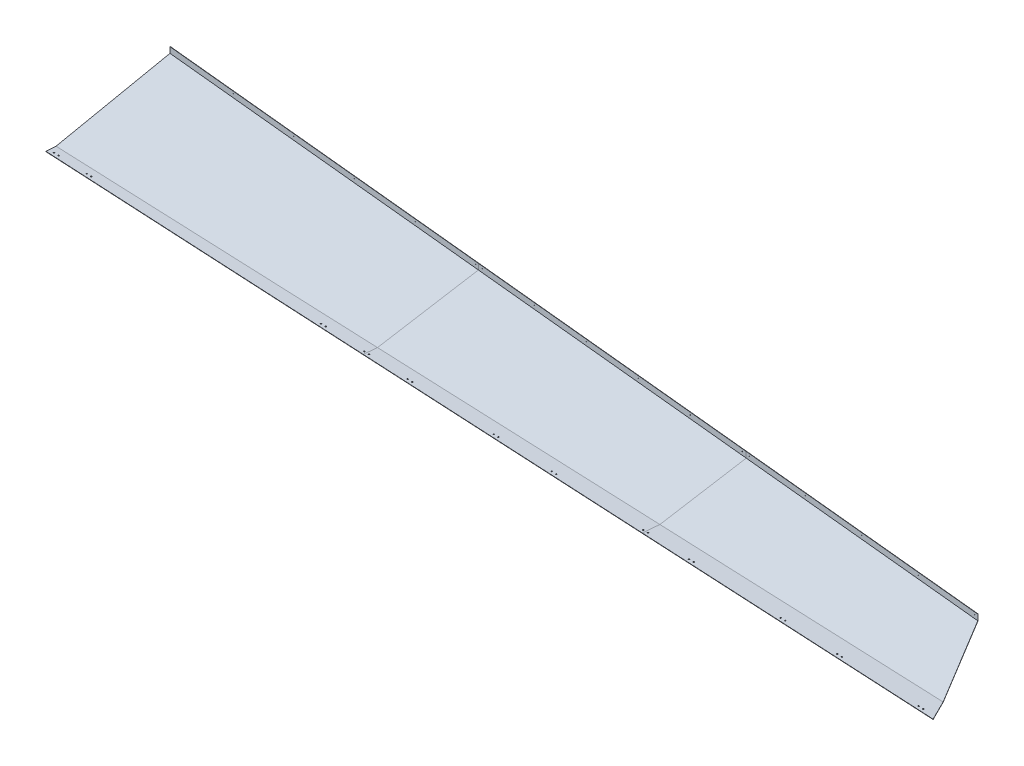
ISO-10303-21;
HEADER;
FILE_DESCRIPTION(('STEP AP214'),'2;1');
FILE_NAME('part.step','',(''),(''),'','','');
FILE_SCHEMA(('AUTOMOTIVE_DESIGN { 1 0 10303 214 1 1 1 1 }'));
ENDSEC;
DATA;
#1=APPLICATION_CONTEXT('core data for automotive mechanical design processes');
#2=APPLICATION_PROTOCOL_DEFINITION('international standard','automotive_design',2000,#1);
#3=PRODUCT_CONTEXT('',#1,'mechanical');
#4=PRODUCT('Part','Part','',(#3));
#5=PRODUCT_RELATED_PRODUCT_CATEGORY('part','',(#4));
#6=PRODUCT_DEFINITION_FORMATION('','',#4);
#7=PRODUCT_DEFINITION_CONTEXT('part definition',#1,'design');
#8=PRODUCT_DEFINITION('design','',#6,#7);
#9=PRODUCT_DEFINITION_SHAPE('','',#8);
#10=(LENGTH_UNIT() NAMED_UNIT(*) SI_UNIT(.MILLI.,.METRE.));
#11=(NAMED_UNIT(*) PLANE_ANGLE_UNIT() SI_UNIT($,.RADIAN.));
#12=(NAMED_UNIT(*) SI_UNIT($,.STERADIAN.) SOLID_ANGLE_UNIT());
#13=UNCERTAINTY_MEASURE_WITH_UNIT(LENGTH_MEASURE(1.E-05),#10,'distance_accuracy_value','');
#14=(GEOMETRIC_REPRESENTATION_CONTEXT(3) GLOBAL_UNCERTAINTY_ASSIGNED_CONTEXT((#13)) GLOBAL_UNIT_ASSIGNED_CONTEXT((#10,
#11,#12)) REPRESENTATION_CONTEXT('',''));
#15=CARTESIAN_POINT('',(0.,0.,0.));
#16=DIRECTION('',(0.,0.,1.));
#17=DIRECTION('',(1.,0.,0.));
#18=AXIS2_PLACEMENT_3D('',#15,#16,#17);
#19=CARTESIAN_POINT('',(-772.827090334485,-140.365470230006,-855.066311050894));
#20=DIRECTION('',(0.999396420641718,0.,0.0347389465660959));
#21=DIRECTION('',(0.0347389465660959,0.,-0.999396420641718));
#22=AXIS2_PLACEMENT_3D('',#19,#20,#21);
#23=PLANE('',#22);
#24=DIRECTION('',(-0.0018418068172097,-0.998593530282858,0.0529864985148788));
#25=VECTOR('',#24,1.);
#26=CARTESIAN_POINT('',(-773.808604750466,-111.612997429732,-826.82935826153));
#27=LINE('',#26,#25);
#28=CARTESIAN_POINT('',(-773.858714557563,-138.781606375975,-825.387761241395));
#29=VERTEX_POINT('',#28);
#30=CARTESIAN_POINT('',(-773.861708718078,-140.404984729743,-825.301622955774));
#31=VERTEX_POINT('',#30);
#32=EDGE_CURVE('E213',#29,#31,#27,.T.);
#33=ORIENTED_EDGE('',*,*,#32,.T.);
#34=DIRECTION('',(0.0346896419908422,-0.0532593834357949,-0.997977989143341));
#35=VECTOR('',#34,1.);
#36=CARTESIAN_POINT('',(-801.761399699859,-97.5702866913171,-22.6621056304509));
#37=LINE('',#36,#35);
#38=CARTESIAN_POINT('',(-771.334892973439,-144.284432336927,-897.994978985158));
#39=VERTEX_POINT('',#38);
#40=EDGE_CURVE('E216',#31,#39,#37,.T.);
#41=ORIENTED_EDGE('',*,*,#40,.T.);
#42=DIRECTION('',(0.0340234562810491,0.201911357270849,-0.978812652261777));
#43=VECTOR('',#42,1.);
#44=CARTESIAN_POINT('',(-799.356363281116,-310.577152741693,-91.8520214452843));
#45=LINE('',#44,#43);
#46=CARTESIAN_POINT('',(-753.442083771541,-38.1,-1412.7489148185));
#47=VERTEX_POINT('',#46);
#48=EDGE_CURVE('E208',#39,#47,#45,.T.);
#49=ORIENTED_EDGE('',*,*,#48,.T.);
#50=DIRECTION('',(0.,-1.,0.));
#51=VECTOR('',#50,1.);
#52=CARTESIAN_POINT('',(-753.44208377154,-1.6256,-1412.7489148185));
#53=LINE('',#52,#51);
#54=CARTESIAN_POINT('',(-753.44208377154,-6.35000000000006,-1412.7489148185));
#55=VERTEX_POINT('',#54);
#56=EDGE_CURVE('E206',#55,#47,#53,.T.);
#57=ORIENTED_EDGE('',*,*,#56,.F.);
#58=DIRECTION('',(-0.0347389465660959,0.,0.999396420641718));
#59=VECTOR('',#58,1.);
#60=CARTESIAN_POINT('',(-801.550823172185,-6.35000000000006,-28.7201312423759));
#61=LINE('',#60,#59);
#62=CARTESIAN_POINT('',(-753.498666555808,-6.35000000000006,-1411.12109827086));
#63=VERTEX_POINT('',#62);
#64=EDGE_CURVE('E191',#55,#63,#61,.T.);
#65=ORIENTED_EDGE('',*,*,#64,.T.);
#66=DIRECTION('',(0.,-1.,0.));
#67=VECTOR('',#66,1.);
#68=CARTESIAN_POINT('',(-753.498666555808,0.,-1411.12109827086));
#69=LINE('',#68,#67);
#70=CARTESIAN_POINT('',(-753.498666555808,-36.7758705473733,-1411.12109827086));
#71=VERTEX_POINT('',#70);
#72=EDGE_CURVE('E204',#63,#71,#69,.T.);
#73=ORIENTED_EDGE('',*,*,#72,.T.);
#74=DIRECTION('',(0.0340234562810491,0.201911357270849,-0.978812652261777));
#75=VECTOR('',#74,1.);
#76=CARTESIAN_POINT('',(-799.367766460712,-308.984906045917,-91.5239661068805));
#77=LINE('',#76,#75);
#78=CARTESIAN_POINT('',(-771.339169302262,-142.649891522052,-897.871954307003));
#79=VERTEX_POINT('',#78);
#80=EDGE_CURVE('E257',#79,#71,#77,.T.);
#81=ORIENTED_EDGE('',*,*,#80,.F.);
#82=DIRECTION('',(0.0346896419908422,-0.0532593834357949,-0.997977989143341));
#83=VECTOR('',#82,1.);
#84=CARTESIAN_POINT('',(-801.758391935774,-95.9469292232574,-22.7486352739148));
#85=LINE('',#84,#83);
#86=EDGE_CURVE('E207',#29,#79,#85,.T.);
#87=ORIENTED_EDGE('',*,*,#86,.F.);
#88=EDGE_LOOP('',(#33,#41,#49,#57,#65,#73,#81,#87));
#89=FACE_BOUND('',#88,.T.);
#90=ADVANCED_FACE('F118',(#89),#23,.T.);
#91=CARTESIAN_POINT('',(0.640160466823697,-90.4141540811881,4.84741055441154));
#92=DIRECTION('',(-0.00706998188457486,0.998540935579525,-0.0535351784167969));
#93=DIRECTION('',(0.,0.0535365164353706,0.998565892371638));
#94=AXIS2_PLACEMENT_3D('',#91,#92,#93);
#95=PLANE('',#94);
#96=CARTESIAN_POINT('',(-2526.22052862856,-159.467879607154,-949.443093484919));
#97=DIRECTION('',(0.00706998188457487,-0.998540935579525,0.0535351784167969));
#98=DIRECTION('',(0.,-0.0535365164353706,-0.998565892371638));
#99=AXIS2_PLACEMENT_3D('',#96,#97,#98);
#100=CIRCLE('',#99,3.17500000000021);
#101=CARTESIAN_POINT('',(-2526.22052862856,-159.637858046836,-952.613540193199));
#102=VERTEX_POINT('',#101);
#103=EDGE_CURVE('E498',#102,#102,#100,.T.);
#104=ORIENTED_EDGE('',*,*,#103,.F.);
#105=EDGE_LOOP('',(#104));
#106=FACE_BOUND('',#105,.T.);
#107=CARTESIAN_POINT('',(-2500.83425263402,-159.245001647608,-948.638533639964));
#108=DIRECTION('',(0.00706998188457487,-0.998540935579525,0.0535351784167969));
#109=DIRECTION('',(0.,-0.0535365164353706,-0.998565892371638));
#110=AXIS2_PLACEMENT_3D('',#107,#108,#109);
#111=CIRCLE('',#110,3.17500000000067);
#112=CARTESIAN_POINT('',(-2500.83425263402,-159.41498008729,-951.808980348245));
#113=VERTEX_POINT('',#112);
#114=EDGE_CURVE('E501',#113,#113,#111,.T.);
#115=ORIENTED_EDGE('',*,*,#114,.F.);
#116=EDGE_LOOP('',(#115));
#117=FACE_BOUND('',#116,.T.);
#118=CARTESIAN_POINT('',(-2342.35129230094,-157.561441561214,-938.166316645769));
#119=DIRECTION('',(0.00706998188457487,-0.998540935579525,0.0535351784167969));
#120=DIRECTION('',(0.,-0.0535365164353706,-0.998565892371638));
#121=AXIS2_PLACEMENT_3D('',#118,#119,#120);
#122=CIRCLE('',#121,3.17500000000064);
#123=CARTESIAN_POINT('',(-2342.35129230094,-157.731420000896,-941.33676335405));
#124=VERTEX_POINT('',#123);
#125=EDGE_CURVE('E506',#124,#124,#122,.T.);
#126=ORIENTED_EDGE('',*,*,#125,.F.);
#127=EDGE_LOOP('',(#126));
#128=FACE_BOUND('',#127,.T.);
#129=CARTESIAN_POINT('',(-2316.9650163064,-157.338563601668,-937.361756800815));
#130=DIRECTION('',(0.00706998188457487,-0.998540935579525,0.0535351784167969));
#131=DIRECTION('',(0.,-0.0535365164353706,-0.998565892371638));
#132=AXIS2_PLACEMENT_3D('',#129,#130,#131);
#133=CIRCLE('',#132,3.17500000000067);
#134=CARTESIAN_POINT('',(-2316.9650163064,-157.50854204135,-940.532203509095));
#135=VERTEX_POINT('',#134);
#136=EDGE_CURVE('E514',#135,#135,#133,.T.);
#137=ORIENTED_EDGE('',*,*,#136,.F.);
#138=EDGE_LOOP('',(#137));
#139=FACE_BOUND('',#138,.T.);
#140=CARTESIAN_POINT('',(-1028.32028440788,-143.936983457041,-857.576247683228));
#141=DIRECTION('',(0.00706998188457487,-0.998540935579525,0.0535351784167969));
#142=DIRECTION('',(0.,-0.0535365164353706,-0.998565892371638));
#143=AXIS2_PLACEMENT_3D('',#140,#141,#142);
#144=CIRCLE('',#143,3.17500000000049);
#145=CARTESIAN_POINT('',(-1028.32028440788,-144.106961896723,-860.746694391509));
#146=VERTEX_POINT('',#145);
#147=EDGE_CURVE('E517',#146,#146,#144,.T.);
#148=ORIENTED_EDGE('',*,*,#147,.F.);
#149=EDGE_LOOP('',(#148));
#150=FACE_BOUND('',#149,.T.);
#151=CARTESIAN_POINT('',(-1002.93400841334,-143.714105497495,-856.771687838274));
#152=DIRECTION('',(0.00706998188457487,-0.998540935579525,0.0535351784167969));
#153=DIRECTION('',(0.,-0.0535365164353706,-0.998565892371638));
#154=AXIS2_PLACEMENT_3D('',#151,#152,#153);
#155=CIRCLE('',#154,3.17500000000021);
#156=CARTESIAN_POINT('',(-1002.93400841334,-143.884083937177,-859.942134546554));
#157=VERTEX_POINT('',#156);
#158=EDGE_CURVE('E467',#157,#157,#155,.T.);
#159=ORIENTED_EDGE('',*,*,#158,.F.);
#160=EDGE_LOOP('',(#159));
#161=FACE_BOUND('',#160,.T.);
#162=CARTESIAN_POINT('',(-785.803102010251,-141.422457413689,-842.702567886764));
#163=DIRECTION('',(0.00706998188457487,-0.998540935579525,0.0535351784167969));
#164=DIRECTION('',(0.,-0.0535365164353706,-0.998565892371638));
#165=AXIS2_PLACEMENT_3D('',#162,#163,#164);
#166=CIRCLE('',#165,3.17500000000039);
#167=CARTESIAN_POINT('',(-785.803102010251,-141.592435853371,-845.873014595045));
#168=VERTEX_POINT('',#167);
#169=EDGE_CURVE('E240',#168,#168,#166,.T.);
#170=ORIENTED_EDGE('',*,*,#169,.F.);
#171=EDGE_LOOP('',(#170));
#172=FACE_BOUND('',#171,.T.);
#173=ORIENTED_EDGE('',*,*,#40,.F.);
#174=DIRECTION('',(-0.998071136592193,-0.010348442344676,-0.0612120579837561));
#175=VECTOR('',#174,1.);
#176=CARTESIAN_POINT('',(2449.09698899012,-106.98792552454,-627.636419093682));
#177=LINE('',#176,#175);
#178=CARTESIAN_POINT('',(-2552.7,-158.848765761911,-934.398408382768));
#179=VERTEX_POINT('',#178);
#180=EDGE_CURVE('E135',#31,#179,#177,.T.);
#181=ORIENTED_EDGE('',*,*,#180,.T.);
#182=DIRECTION('',(0.,0.0535365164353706,0.998565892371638));
#183=VECTOR('',#182,1.);
#184=CARTESIAN_POINT('',(-2552.7,-108.44078468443,5.81387958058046));
#185=LINE('',#184,#183);
#186=CARTESIAN_POINT('',(-2552.7,-161.69252197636,-987.44029737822));
#187=VERTEX_POINT('',#186);
#188=EDGE_CURVE('E248',#187,#179,#185,.T.);
#189=ORIENTED_EDGE('',*,*,#188,.F.);
#190=DIRECTION('',(-0.998694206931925,-0.0097595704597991,-0.0501461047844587));
#191=VECTOR('',#190,1.);
#192=CARTESIAN_POINT('',(2681.78340615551,-110.539416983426,-724.60813959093));
#193=LINE('',#192,#191);
#194=EDGE_CURVE('E229',#39,#187,#193,.T.);
#195=ORIENTED_EDGE('',*,*,#194,.F.);
#196=EDGE_LOOP('',(#173,#181,#189,#195));
#197=FACE_BOUND('',#196,.T.);
#198=ADVANCED_FACE('F264',(#106,#117,#128,#139,#150,#161,#172,#197),#95,.F.);
#199=CARTESIAN_POINT('',(2449.09698899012,-106.98792552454,-627.636419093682));
#200=DIRECTION('',(0.0616767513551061,-0.0529991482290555,-0.996688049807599));
#201=DIRECTION('',(-0.998090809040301,0.,-0.0617635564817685));
#202=AXIS2_PLACEMENT_3D('',#199,#200,#201);
#203=PLANE('',#202);
#204=ORIENTED_EDGE('',*,*,#32,.F.);
#205=DIRECTION('',(-0.998071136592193,-0.010348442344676,-0.0612120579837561));
#206=VECTOR('',#205,1.);
#207=CARTESIAN_POINT('',(2449.08549602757,-105.364697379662,-627.723445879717));
#208=LINE('',#207,#206);
#209=CARTESIAN_POINT('',(-2552.7,-157.225418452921,-934.484730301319));
#210=VERTEX_POINT('',#209);
#211=EDGE_CURVE('E143',#29,#210,#208,.T.);
#212=ORIENTED_EDGE('',*,*,#211,.T.);
#213=DIRECTION('',(0.,0.998589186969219,-0.0531002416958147));
#214=VECTOR('',#213,1.);
#215=CARTESIAN_POINT('',(-2552.7,-123.400309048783,-936.283389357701));
#216=LINE('',#215,#214);
#217=EDGE_CURVE('E13',#179,#210,#216,.T.);
#218=ORIENTED_EDGE('',*,*,#217,.F.);
#219=ORIENTED_EDGE('',*,*,#180,.F.);
#220=EDGE_LOOP('',(#204,#212,#218,#219));
#221=FACE_BOUND('',#220,.T.);
#222=ADVANCED_FACE('F279',(#221),#203,.F.);
#223=CARTESIAN_POINT('',(0.628667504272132,-88.79092593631,4.7603837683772));
#224=DIRECTION('',(-0.00706998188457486,0.998540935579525,-0.0535351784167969));
#225=DIRECTION('',(0.,0.0535365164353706,0.998565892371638));
#226=AXIS2_PLACEMENT_3D('',#223,#224,#225);
#227=PLANE('',#226);
#228=CARTESIAN_POINT('',(-2526.23202159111,-157.844651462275,-949.530120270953));
#229=DIRECTION('',(-0.00706998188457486,0.998540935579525,-0.0535351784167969));
#230=DIRECTION('',(0.,0.0535365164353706,0.998565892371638));
#231=AXIS2_PLACEMENT_3D('',#228,#229,#230);
#232=CIRCLE('',#231,3.17500000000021);
#233=CARTESIAN_POINT('',(-2526.23202159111,-157.674673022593,-946.359673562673));
#234=VERTEX_POINT('',#233);
#235=EDGE_CURVE('E214',#234,#234,#232,.T.);
#236=ORIENTED_EDGE('',*,*,#235,.F.);
#237=EDGE_LOOP('',(#236));
#238=FACE_BOUND('',#237,.T.);
#239=CARTESIAN_POINT('',(-2500.84574559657,-157.62177350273,-948.725560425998));
#240=DIRECTION('',(-0.00706998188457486,0.998540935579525,-0.0535351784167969));
#241=DIRECTION('',(0.,0.0535365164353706,0.998565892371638));
#242=AXIS2_PLACEMENT_3D('',#239,#240,#241);
#243=CIRCLE('',#242,3.17500000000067);
#244=CARTESIAN_POINT('',(-2500.84574559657,-157.451795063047,-945.555113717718));
#245=VERTEX_POINT('',#244);
#246=EDGE_CURVE('E219',#245,#245,#243,.T.);
#247=ORIENTED_EDGE('',*,*,#246,.F.);
#248=EDGE_LOOP('',(#247));
#249=FACE_BOUND('',#248,.T.);
#250=CARTESIAN_POINT('',(-2342.3627852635,-155.938213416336,-938.253343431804));
#251=DIRECTION('',(-0.00706998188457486,0.998540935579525,-0.0535351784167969));
#252=DIRECTION('',(0.,0.0535365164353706,0.998565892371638));
#253=AXIS2_PLACEMENT_3D('',#250,#251,#252);
#254=CIRCLE('',#253,3.17500000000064);
#255=CARTESIAN_POINT('',(-2342.3627852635,-155.768234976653,-935.082896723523));
#256=VERTEX_POINT('',#255);
#257=EDGE_CURVE('E485',#256,#256,#254,.T.);
#258=ORIENTED_EDGE('',*,*,#257,.F.);
#259=EDGE_LOOP('',(#258));
#260=FACE_BOUND('',#259,.T.);
#261=CARTESIAN_POINT('',(-2316.97650926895,-155.71533545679,-937.448783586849));
#262=DIRECTION('',(-0.00706998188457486,0.998540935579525,-0.0535351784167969));
#263=DIRECTION('',(0.,0.0535365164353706,0.998565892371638));
#264=AXIS2_PLACEMENT_3D('',#261,#262,#263);
#265=CIRCLE('',#264,3.17500000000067);
#266=CARTESIAN_POINT('',(-2316.97650926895,-155.545357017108,-934.278336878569));
#267=VERTEX_POINT('',#266);
#268=EDGE_CURVE('E488',#267,#267,#265,.T.);
#269=ORIENTED_EDGE('',*,*,#268,.F.);
#270=EDGE_LOOP('',(#269));
#271=FACE_BOUND('',#270,.T.);
#272=CARTESIAN_POINT('',(-1028.33177737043,-142.313755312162,-857.663274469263));
#273=DIRECTION('',(-0.00706998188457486,0.998540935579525,-0.0535351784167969));
#274=DIRECTION('',(0.,0.0535365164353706,0.998565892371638));
#275=AXIS2_PLACEMENT_3D('',#272,#273,#274);
#276=CIRCLE('',#275,3.17500000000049);
#277=CARTESIAN_POINT('',(-1028.33177737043,-142.14377687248,-854.492827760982));
#278=VERTEX_POINT('',#277);
#279=EDGE_CURVE('E491',#278,#278,#276,.T.);
#280=ORIENTED_EDGE('',*,*,#279,.F.);
#281=EDGE_LOOP('',(#280));
#282=FACE_BOUND('',#281,.T.);
#283=CARTESIAN_POINT('',(-1002.94550137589,-142.090877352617,-856.858714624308));
#284=DIRECTION('',(-0.00706998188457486,0.998540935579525,-0.0535351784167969));
#285=DIRECTION('',(0.,0.0535365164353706,0.998565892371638));
#286=AXIS2_PLACEMENT_3D('',#283,#284,#285);
#287=CIRCLE('',#286,3.17500000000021);
#288=CARTESIAN_POINT('',(-1002.94550137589,-141.920898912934,-853.688267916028));
#289=VERTEX_POINT('',#288);
#290=EDGE_CURVE('E494',#289,#289,#287,.T.);
#291=ORIENTED_EDGE('',*,*,#290,.F.);
#292=EDGE_LOOP('',(#291));
#293=FACE_BOUND('',#292,.T.);
#294=CARTESIAN_POINT('',(-785.814594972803,-139.799229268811,-842.789594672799));
#295=DIRECTION('',(-0.00706998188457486,0.998540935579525,-0.0535351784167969));
#296=DIRECTION('',(0.,0.0535365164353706,0.998565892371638));
#297=AXIS2_PLACEMENT_3D('',#294,#295,#296);
#298=CIRCLE('',#297,3.17500000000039);
#299=CARTESIAN_POINT('',(-785.814594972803,-139.629250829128,-839.619147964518));
#300=VERTEX_POINT('',#299);
#301=EDGE_CURVE('E496',#300,#300,#298,.T.);
#302=ORIENTED_EDGE('',*,*,#301,.F.);
#303=EDGE_LOOP('',(#302));
#304=FACE_BOUND('',#303,.T.);
#305=ORIENTED_EDGE('',*,*,#211,.F.);
#306=ORIENTED_EDGE('',*,*,#86,.T.);
#307=DIRECTION('',(0.998694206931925,0.00975957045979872,0.050146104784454));
#308=VECTOR('',#307,1.);
#309=CARTESIAN_POINT('',(44.3432683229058,-134.678772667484,-856.915176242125));
#310=LINE('',#309,#308);
#311=CARTESIAN_POINT('',(-2552.7,-160.057939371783,-987.317057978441));
#312=VERTEX_POINT('',#311);
#313=EDGE_CURVE('E223',#312,#79,#310,.T.);
#314=ORIENTED_EDGE('',*,*,#313,.F.);
#315=DIRECTION('',(0.,0.0535365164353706,0.998565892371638));
#316=VECTOR('',#315,1.);
#317=CARTESIAN_POINT('',(-2552.7,-106.817475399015,5.72684844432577));
#318=LINE('',#317,#316);
#319=EDGE_CURVE('E250',#312,#210,#318,.T.);
#320=ORIENTED_EDGE('',*,*,#319,.T.);
#321=EDGE_LOOP('',(#305,#306,#314,#320));
#322=FACE_BOUND('',#321,.T.);
#323=ADVANCED_FACE('F278',(#238,#249,#260,#271,#282,#293,#304,#322),#227,.T.);
#324=CARTESIAN_POINT('',(6.00801669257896,-298.980404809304,-61.4654149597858));
#325=DIRECTION('',(-0.0196795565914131,0.979325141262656,0.201333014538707));
#326=DIRECTION('',(0.,-0.201372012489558,0.979514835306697));
#327=AXIS2_PLACEMENT_3D('',#324,#325,#326);
#328=PLANE('',#327);
#329=ORIENTED_EDGE('',*,*,#313,.T.);
#330=ORIENTED_EDGE('',*,*,#80,.T.);
#331=DIRECTION('',(-0.995256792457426,0.,-0.0972826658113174));
#332=VECTOR('',#331,1.);
#333=CARTESIAN_POINT('',(129.495437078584,-36.7758705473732,-1324.81169455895));
#334=LINE('',#333,#332);
#335=CARTESIAN_POINT('',(-2552.7,-36.7758705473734,-1586.98636578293));
#336=VERTEX_POINT('',#335);
#337=EDGE_CURVE('E211',#71,#336,#334,.T.);
#338=ORIENTED_EDGE('',*,*,#337,.T.);
#339=DIRECTION('',(0.,-0.201372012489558,0.979514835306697));
#340=VECTOR('',#339,1.);
#341=CARTESIAN_POINT('',(-2552.7,-348.312682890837,-71.6073135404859));
#342=LINE('',#341,#340);
#343=EDGE_CURVE('E226',#336,#312,#342,.T.);
#344=ORIENTED_EDGE('',*,*,#343,.T.);
#345=EDGE_LOOP('',(#329,#330,#338,#344));
#346=FACE_BOUND('',#345,.T.);
#347=ADVANCED_FACE('F276',(#346),#328,.T.);
#348=CARTESIAN_POINT('',(-2552.7,0.,1.09982839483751E-12));
#349=DIRECTION('',(-1.,0.,0.));
#350=DIRECTION('',(0.,0.,1.));
#351=AXIS2_PLACEMENT_3D('',#348,#349,#350);
#352=PLANE('',#351);
#353=DIRECTION('',(0.,0.,1.));
#354=VECTOR('',#353,1.);
#355=CARTESIAN_POINT('',(-2552.7,-6.35000000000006,1.09982530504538E-12));
#356=LINE('',#355,#354);
#357=CARTESIAN_POINT('',(-2552.7,-6.35000000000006,-1588.61971308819));
#358=VERTEX_POINT('',#357);
#359=CARTESIAN_POINT('',(-2552.7,-6.35000000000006,-1586.98636578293));
#360=VERTEX_POINT('',#359);
#361=EDGE_CURVE('E194',#358,#360,#356,.T.);
#362=ORIENTED_EDGE('',*,*,#361,.F.);
#363=DIRECTION('',(0.,1.,0.));
#364=VECTOR('',#363,1.);
#365=CARTESIAN_POINT('',(-2552.7,-1.62560000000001,-1588.61971308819));
#366=LINE('',#365,#364);
#367=CARTESIAN_POINT('',(-2552.7,-38.1,-1588.61971308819));
#368=VERTEX_POINT('',#367);
#369=EDGE_CURVE('E252',#368,#358,#366,.T.);
#370=ORIENTED_EDGE('',*,*,#369,.F.);
#371=DIRECTION('',(0.,-0.201372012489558,0.979514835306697));
#372=VECTOR('',#371,1.);
#373=CARTESIAN_POINT('',(-2552.7,-349.90529063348,-71.9347272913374));
#374=LINE('',#373,#372);
#375=EDGE_CURVE('E245',#368,#187,#374,.T.);
#376=ORIENTED_EDGE('',*,*,#375,.T.);
#377=ORIENTED_EDGE('',*,*,#188,.T.);
#378=ORIENTED_EDGE('',*,*,#217,.T.);
#379=ORIENTED_EDGE('',*,*,#319,.F.);
#380=ORIENTED_EDGE('',*,*,#343,.F.);
#381=DIRECTION('',(0.,1.,0.));
#382=VECTOR('',#381,1.);
#383=CARTESIAN_POINT('',(-2552.7,0.,-1586.98636578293));
#384=LINE('',#383,#382);
#385=EDGE_CURVE('E127',#336,#360,#384,.T.);
#386=ORIENTED_EDGE('',*,*,#385,.T.);
#387=EDGE_LOOP('',(#362,#370,#376,#377,#378,#379,#380,#386));
#388=FACE_BOUND('',#387,.T.);
#389=ADVANCED_FACE('F271',(#388),#352,.T.);
#390=CARTESIAN_POINT('',(6.04000777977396,-300.572395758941,-61.7927019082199));
#391=DIRECTION('',(-0.0196795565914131,0.979325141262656,0.201333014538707));
#392=DIRECTION('',(0.,-0.201372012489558,0.979514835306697));
#393=AXIS2_PLACEMENT_3D('',#390,#391,#392);
#394=PLANE('',#393);
#395=ORIENTED_EDGE('',*,*,#48,.F.);
#396=ORIENTED_EDGE('',*,*,#194,.T.);
#397=ORIENTED_EDGE('',*,*,#375,.F.);
#398=DIRECTION('',(-0.995256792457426,0.,-0.0972826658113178));
#399=VECTOR('',#398,1.);
#400=CARTESIAN_POINT('',(2189.57620919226,-38.1000000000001,-1125.07977531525));
#401=LINE('',#400,#399);
#402=EDGE_CURVE('E199',#47,#368,#401,.T.);
#403=ORIENTED_EDGE('',*,*,#402,.F.);
#404=EDGE_LOOP('',(#395,#396,#397,#403));
#405=FACE_BOUND('',#404,.T.);
#406=ADVANCED_FACE('F267',(#405),#394,.F.);
#407=CARTESIAN_POINT('',(2372.85225668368,-6.35000000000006,81.6218878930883));
#408=DIRECTION('',(0.,-1.,0.));
#409=DIRECTION('',(0.,0.,-1.));
#410=AXIS2_PLACEMENT_3D('',#407,#408,#409);
#411=PLANE('',#410);
#412=ORIENTED_EDGE('',*,*,#64,.F.);
#413=DIRECTION('',(-0.995256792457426,0.,-0.0972826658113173));
#414=VECTOR('',#413,1.);
#415=CARTESIAN_POINT('',(-2552.7,-6.35000000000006,-1588.61971308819));
#416=LINE('',#415,#414);
#417=EDGE_CURVE('E231',#55,#358,#416,.T.);
#418=ORIENTED_EDGE('',*,*,#417,.T.);
#419=ORIENTED_EDGE('',*,*,#361,.T.);
#420=DIRECTION('',(-0.995256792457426,0.,-0.0972826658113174));
#421=VECTOR('',#420,1.);
#422=CARTESIAN_POINT('',(129.495437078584,-6.35000000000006,-1324.81169455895));
#423=LINE('',#422,#421);
#424=EDGE_CURVE('E188',#63,#360,#423,.T.);
#425=ORIENTED_EDGE('',*,*,#424,.F.);
#426=EDGE_LOOP('',(#412,#418,#419,#425));
#427=FACE_BOUND('',#426,.T.);
#428=ADVANCED_FACE('F190',(#427),#411,.F.);
#429=CARTESIAN_POINT('',(-2552.7,-1.62560000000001,-1588.61971308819));
#430=DIRECTION('',(0.0972826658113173,0.,-0.995256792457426));
#431=DIRECTION('',(-0.995256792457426,0.,-0.0972826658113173));
#432=AXIS2_PLACEMENT_3D('',#429,#430,#431);
#433=PLANE('',#432);
#434=CARTESIAN_POINT('',(-2537.98418614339,-19.05,-1587.18129677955));
#435=DIRECTION('',(0.0972826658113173,0.,-0.995256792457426));
#436=DIRECTION('',(-0.995256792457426,0.,-0.0972826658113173));
#437=AXIS2_PLACEMENT_3D('',#434,#435,#436);
#438=CIRCLE('',#437,1.58749999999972);
#439=CARTESIAN_POINT('',(-2539.56415630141,-19.05,-1587.33573301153));
#440=VERTEX_POINT('',#439);
#441=EDGE_CURVE('E463',#440,#440,#438,.T.);
#442=ORIENTED_EDGE('',*,*,#441,.F.);
#443=EDGE_LOOP('',(#442));
#444=FACE_BOUND('',#443,.T.);
#445=CARTESIAN_POINT('',(-2184.07087074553,-19.05,-1552.58758081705));
#446=DIRECTION('',(0.0972826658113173,0.,-0.995256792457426));
#447=DIRECTION('',(-0.995256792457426,0.,-0.0972826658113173));
#448=AXIS2_PLACEMENT_3D('',#445,#446,#447);
#449=CIRCLE('',#448,1.58750000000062);
#450=CARTESIAN_POINT('',(-2185.65084090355,-19.05,-1552.74201704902));
#451=VERTEX_POINT('',#450);
#452=EDGE_CURVE('E545',#451,#451,#449,.T.);
#453=ORIENTED_EDGE('',*,*,#452,.F.);
#454=EDGE_LOOP('',(#453));
#455=FACE_BOUND('',#454,.T.);
#456=CARTESIAN_POINT('',(-1830.15755534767,-19.05,-1517.99386485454));
#457=DIRECTION('',(0.0972826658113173,0.,-0.995256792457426));
#458=DIRECTION('',(-0.995256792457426,0.,-0.0972826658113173));
#459=AXIS2_PLACEMENT_3D('',#456,#457,#458);
#460=CIRCLE('',#459,1.58750000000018);
#461=CARTESIAN_POINT('',(-1831.73752550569,-19.05,-1518.14830108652));
#462=VERTEX_POINT('',#461);
#463=EDGE_CURVE('E542',#462,#462,#460,.T.);
#464=ORIENTED_EDGE('',*,*,#463,.F.);
#465=EDGE_LOOP('',(#464));
#466=FACE_BOUND('',#465,.T.);
#467=CARTESIAN_POINT('',(-1476.24423994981,-19.05,-1483.40014889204));
#468=DIRECTION('',(0.0972826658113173,0.,-0.995256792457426));
#469=DIRECTION('',(-0.995256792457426,0.,-0.0972826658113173));
#470=AXIS2_PLACEMENT_3D('',#467,#468,#469);
#471=CIRCLE('',#470,1.58749999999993);
#472=CARTESIAN_POINT('',(-1477.82421010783,-19.05,-1483.55458512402));
#473=VERTEX_POINT('',#472);
#474=EDGE_CURVE('E539',#473,#473,#471,.T.);
#475=ORIENTED_EDGE('',*,*,#474,.F.);
#476=EDGE_LOOP('',(#475));
#477=FACE_BOUND('',#476,.T.);
#478=CARTESIAN_POINT('',(-1122.33092455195,-19.05,-1448.80643292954));
#479=DIRECTION('',(0.0972826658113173,0.,-0.995256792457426));
#480=DIRECTION('',(-0.995256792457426,0.,-0.0972826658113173));
#481=AXIS2_PLACEMENT_3D('',#478,#479,#480);
#482=CIRCLE('',#481,1.58749999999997);
#483=CARTESIAN_POINT('',(-1123.91089470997,-19.05,-1448.96086916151));
#484=VERTEX_POINT('',#483);
#485=EDGE_CURVE('E536',#484,#484,#482,.T.);
#486=ORIENTED_EDGE('',*,*,#485,.F.);
#487=EDGE_LOOP('',(#486));
#488=FACE_BOUND('',#487,.T.);
#489=CARTESIAN_POINT('',(-768.417609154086,-19.05,-1414.21271696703));
#490=DIRECTION('',(0.0972826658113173,0.,-0.995256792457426));
#491=DIRECTION('',(-0.995256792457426,0.,-0.0972826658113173));
#492=AXIS2_PLACEMENT_3D('',#489,#490,#491);
#493=CIRCLE('',#492,1.58749999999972);
#494=CARTESIAN_POINT('',(-769.997579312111,-19.05,-1414.36715319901));
#495=VERTEX_POINT('',#494);
#496=EDGE_CURVE('E509',#495,#495,#493,.T.);
#497=ORIENTED_EDGE('',*,*,#496,.F.);
#498=EDGE_LOOP('',(#497));
#499=FACE_BOUND('',#498,.T.);
#500=ORIENTED_EDGE('',*,*,#417,.F.);
#501=ORIENTED_EDGE('',*,*,#56,.T.);
#502=ORIENTED_EDGE('',*,*,#402,.T.);
#503=ORIENTED_EDGE('',*,*,#369,.T.);
#504=EDGE_LOOP('',(#500,#501,#502,#503));
#505=FACE_BOUND('',#504,.T.);
#506=ADVANCED_FACE('F120',(#444,#455,#466,#477,#488,#499,#505),#433,.T.);
#507=CARTESIAN_POINT('',(129.495437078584,0.,-1324.81169455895));
#508=DIRECTION('',(0.0972826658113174,0.,-0.995256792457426));
#509=DIRECTION('',(-0.995256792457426,0.,-0.0972826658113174));
#510=AXIS2_PLACEMENT_3D('',#507,#508,#509);
#511=PLANE('',#510);
#512=CARTESIAN_POINT('',(-2538.14232884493,-19.05,-1585.56340733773));
#513=DIRECTION('',(0.0972826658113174,0.,-0.995256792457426));
#514=DIRECTION('',(-0.995256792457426,0.,-0.0972826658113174));
#515=AXIS2_PLACEMENT_3D('',#512,#513,#514);
#516=CIRCLE('',#515,1.58749999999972);
#517=CARTESIAN_POINT('',(-2539.72229900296,-19.05,-1585.71784356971));
#518=VERTEX_POINT('',#517);
#519=EDGE_CURVE('E122',#518,#518,#516,.T.);
#520=ORIENTED_EDGE('',*,*,#519,.T.);
#521=EDGE_LOOP('',(#520));
#522=FACE_BOUND('',#521,.T.);
#523=CARTESIAN_POINT('',(-2184.22901344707,-19.05,-1550.96969137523));
#524=DIRECTION('',(0.0972826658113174,0.,-0.995256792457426));
#525=DIRECTION('',(-0.995256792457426,0.,-0.0972826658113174));
#526=AXIS2_PLACEMENT_3D('',#523,#524,#525);
#527=CIRCLE('',#526,1.58750000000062);
#528=CARTESIAN_POINT('',(-2185.8089836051,-19.05,-1551.1241276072));
#529=VERTEX_POINT('',#528);
#530=EDGE_CURVE('E465',#529,#529,#527,.T.);
#531=ORIENTED_EDGE('',*,*,#530,.T.);
#532=EDGE_LOOP('',(#531));
#533=FACE_BOUND('',#532,.T.);
#534=CARTESIAN_POINT('',(-1830.31569804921,-19.05,-1516.37597541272));
#535=DIRECTION('',(0.0972826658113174,0.,-0.995256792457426));
#536=DIRECTION('',(-0.995256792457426,0.,-0.0972826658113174));
#537=AXIS2_PLACEMENT_3D('',#534,#535,#536);
#538=CIRCLE('',#537,1.58750000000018);
#539=CARTESIAN_POINT('',(-1831.89566820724,-19.05,-1516.5304116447));
#540=VERTEX_POINT('',#539);
#541=EDGE_CURVE('E469',#540,#540,#538,.T.);
#542=ORIENTED_EDGE('',*,*,#541,.T.);
#543=EDGE_LOOP('',(#542));
#544=FACE_BOUND('',#543,.T.);
#545=CARTESIAN_POINT('',(-1476.40238265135,-19.05,-1481.78225945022));
#546=DIRECTION('',(0.0972826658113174,0.,-0.995256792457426));
#547=DIRECTION('',(-0.995256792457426,0.,-0.0972826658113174));
#548=AXIS2_PLACEMENT_3D('',#545,#546,#547);
#549=CIRCLE('',#548,1.58749999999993);
#550=CARTESIAN_POINT('',(-1477.98235280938,-19.05,-1481.93669568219));
#551=VERTEX_POINT('',#550);
#552=EDGE_CURVE('E472',#551,#551,#549,.T.);
#553=ORIENTED_EDGE('',*,*,#552,.T.);
#554=EDGE_LOOP('',(#553));
#555=FACE_BOUND('',#554,.T.);
#556=CARTESIAN_POINT('',(-1122.48906725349,-19.05,-1447.18854348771));
#557=DIRECTION('',(0.0972826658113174,0.,-0.995256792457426));
#558=DIRECTION('',(-0.995256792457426,0.,-0.0972826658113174));
#559=AXIS2_PLACEMENT_3D('',#556,#557,#558);
#560=CIRCLE('',#559,1.58749999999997);
#561=CARTESIAN_POINT('',(-1124.06903741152,-19.05,-1447.34297971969));
#562=VERTEX_POINT('',#561);
#563=EDGE_CURVE('E477',#562,#562,#560,.T.);
#564=ORIENTED_EDGE('',*,*,#563,.T.);
#565=EDGE_LOOP('',(#564));
#566=FACE_BOUND('',#565,.T.);
#567=CARTESIAN_POINT('',(-768.575751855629,-19.05,-1412.59482752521));
#568=DIRECTION('',(0.0972826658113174,0.,-0.995256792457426));
#569=DIRECTION('',(-0.995256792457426,0.,-0.0972826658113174));
#570=AXIS2_PLACEMENT_3D('',#567,#568,#569);
#571=CIRCLE('',#570,1.58749999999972);
#572=CARTESIAN_POINT('',(-770.155722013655,-19.05,-1412.74926375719));
#573=VERTEX_POINT('',#572);
#574=EDGE_CURVE('E480',#573,#573,#571,.T.);
#575=ORIENTED_EDGE('',*,*,#574,.T.);
#576=EDGE_LOOP('',(#575));
#577=FACE_BOUND('',#576,.T.);
#578=ORIENTED_EDGE('',*,*,#72,.F.);
#579=ORIENTED_EDGE('',*,*,#424,.T.);
#580=ORIENTED_EDGE('',*,*,#385,.F.);
#581=ORIENTED_EDGE('',*,*,#337,.F.);
#582=EDGE_LOOP('',(#578,#579,#580,#581));
#583=FACE_BOUND('',#582,.T.);
#584=ADVANCED_FACE('F210',(#522,#533,#544,#555,#566,#577,#583),#511,.F.);
#585=CARTESIAN_POINT('',(-785.821059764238,-138.886163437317,-842.838547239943));
#586=DIRECTION('',(0.00706998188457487,-0.998540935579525,0.0535351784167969));
#587=DIRECTION('',(0.,-0.0535365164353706,-0.998565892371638));
#588=AXIS2_PLACEMENT_3D('',#585,#586,#587);
#589=CYLINDRICAL_SURFACE('',#588,3.17500000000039);
#590=ORIENTED_EDGE('',*,*,#301,.T.);
#591=EDGE_LOOP('',(#590));
#592=FACE_BOUND('',#591,.T.);
#593=ORIENTED_EDGE('',*,*,#169,.T.);
#594=EDGE_LOOP('',(#593));
#595=FACE_BOUND('',#594,.T.);
#596=ADVANCED_FACE('F295',(#592,#595),#589,.F.);
#597=CARTESIAN_POINT('',(-1002.95196616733,-141.177811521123,-856.907667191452));
#598=DIRECTION('',(0.00706998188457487,-0.998540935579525,0.0535351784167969));
#599=DIRECTION('',(0.,-0.0535365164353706,-0.998565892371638));
#600=AXIS2_PLACEMENT_3D('',#597,#598,#599);
#601=CYLINDRICAL_SURFACE('',#600,3.17500000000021);
#602=ORIENTED_EDGE('',*,*,#290,.T.);
#603=EDGE_LOOP('',(#602));
#604=FACE_BOUND('',#603,.T.);
#605=ORIENTED_EDGE('',*,*,#158,.T.);
#606=EDGE_LOOP('',(#605));
#607=FACE_BOUND('',#606,.T.);
#608=ADVANCED_FACE('F302',(#604,#607),#601,.F.);
#609=CARTESIAN_POINT('',(-1028.33824216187,-141.400689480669,-857.712227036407));
#610=DIRECTION('',(0.00706998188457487,-0.998540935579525,0.0535351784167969));
#611=DIRECTION('',(0.,-0.0535365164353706,-0.998565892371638));
#612=AXIS2_PLACEMENT_3D('',#609,#610,#611);
#613=CYLINDRICAL_SURFACE('',#612,3.17500000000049);
#614=ORIENTED_EDGE('',*,*,#279,.T.);
#615=EDGE_LOOP('',(#614));
#616=FACE_BOUND('',#615,.T.);
#617=ORIENTED_EDGE('',*,*,#147,.T.);
#618=EDGE_LOOP('',(#617));
#619=FACE_BOUND('',#618,.T.);
#620=ADVANCED_FACE('F354',(#616,#619),#613,.F.);
#621=CARTESIAN_POINT('',(-2316.98297406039,-154.802269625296,-937.497736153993));
#622=DIRECTION('',(0.00706998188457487,-0.998540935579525,0.0535351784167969));
#623=DIRECTION('',(0.,-0.0535365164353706,-0.998565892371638));
#624=AXIS2_PLACEMENT_3D('',#621,#622,#623);
#625=CYLINDRICAL_SURFACE('',#624,3.17500000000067);
#626=ORIENTED_EDGE('',*,*,#268,.T.);
#627=EDGE_LOOP('',(#626));
#628=FACE_BOUND('',#627,.T.);
#629=ORIENTED_EDGE('',*,*,#136,.T.);
#630=EDGE_LOOP('',(#629));
#631=FACE_BOUND('',#630,.T.);
#632=ADVANCED_FACE('F363',(#628,#631),#625,.F.);
#633=CARTESIAN_POINT('',(-2342.36925005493,-155.025147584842,-938.302295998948));
#634=DIRECTION('',(0.00706998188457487,-0.998540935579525,0.0535351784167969));
#635=DIRECTION('',(0.,-0.0535365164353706,-0.998565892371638));
#636=AXIS2_PLACEMENT_3D('',#633,#634,#635);
#637=CYLINDRICAL_SURFACE('',#636,3.17500000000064);
#638=ORIENTED_EDGE('',*,*,#257,.T.);
#639=EDGE_LOOP('',(#638));
#640=FACE_BOUND('',#639,.T.);
#641=ORIENTED_EDGE('',*,*,#125,.T.);
#642=EDGE_LOOP('',(#641));
#643=FACE_BOUND('',#642,.T.);
#644=ADVANCED_FACE('F372',(#640,#643),#637,.F.);
#645=CARTESIAN_POINT('',(-2500.85221038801,-156.708707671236,-948.774512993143));
#646=DIRECTION('',(0.00706998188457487,-0.998540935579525,0.0535351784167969));
#647=DIRECTION('',(0.,-0.0535365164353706,-0.998565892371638));
#648=AXIS2_PLACEMENT_3D('',#645,#646,#647);
#649=CYLINDRICAL_SURFACE('',#648,3.17500000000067);
#650=ORIENTED_EDGE('',*,*,#246,.T.);
#651=EDGE_LOOP('',(#650));
#652=FACE_BOUND('',#651,.T.);
#653=ORIENTED_EDGE('',*,*,#114,.T.);
#654=EDGE_LOOP('',(#653));
#655=FACE_BOUND('',#654,.T.);
#656=ADVANCED_FACE('F381',(#652,#655),#649,.F.);
#657=CARTESIAN_POINT('',(-2526.23848638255,-156.931585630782,-949.579072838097));
#658=DIRECTION('',(0.00706998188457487,-0.998540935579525,0.0535351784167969));
#659=DIRECTION('',(0.,-0.0535365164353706,-0.998565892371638));
#660=AXIS2_PLACEMENT_3D('',#657,#658,#659);
#661=CYLINDRICAL_SURFACE('',#660,3.17500000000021);
#662=ORIENTED_EDGE('',*,*,#235,.T.);
#663=EDGE_LOOP('',(#662));
#664=FACE_BOUND('',#663,.T.);
#665=ORIENTED_EDGE('',*,*,#103,.T.);
#666=EDGE_LOOP('',(#665));
#667=FACE_BOUND('',#666,.T.);
#668=ADVANCED_FACE('F390',(#664,#667),#661,.F.);
#669=CARTESIAN_POINT('',(-768.664707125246,-19.05,-1411.68476471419));
#670=DIRECTION('',(0.0972826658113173,0.,-0.995256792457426));
#671=DIRECTION('',(-0.995256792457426,0.,-0.0972826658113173));
#672=AXIS2_PLACEMENT_3D('',#669,#670,#671);
#673=CYLINDRICAL_SURFACE('',#672,1.58749999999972);
#674=ORIENTED_EDGE('',*,*,#496,.T.);
#675=EDGE_LOOP('',(#674));
#676=FACE_BOUND('',#675,.T.);
#677=ORIENTED_EDGE('',*,*,#574,.F.);
#678=EDGE_LOOP('',(#677));
#679=FACE_BOUND('',#678,.T.);
#680=ADVANCED_FACE('F398',(#676,#679),#673,.F.);
#681=CARTESIAN_POINT('',(-1122.57802252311,-19.05,-1446.27848067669));
#682=DIRECTION('',(0.0972826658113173,0.,-0.995256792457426));
#683=DIRECTION('',(-0.995256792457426,0.,-0.0972826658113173));
#684=AXIS2_PLACEMENT_3D('',#681,#682,#683);
#685=CYLINDRICAL_SURFACE('',#684,1.58749999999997);
#686=ORIENTED_EDGE('',*,*,#485,.T.);
#687=EDGE_LOOP('',(#686));
#688=FACE_BOUND('',#687,.T.);
#689=ORIENTED_EDGE('',*,*,#563,.F.);
#690=EDGE_LOOP('',(#689));
#691=FACE_BOUND('',#690,.T.);
#692=ADVANCED_FACE('F406',(#688,#691),#685,.F.);
#693=CARTESIAN_POINT('',(-1476.49133792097,-19.05,-1480.8721966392));
#694=DIRECTION('',(0.0972826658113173,0.,-0.995256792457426));
#695=DIRECTION('',(-0.995256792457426,0.,-0.0972826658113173));
#696=AXIS2_PLACEMENT_3D('',#693,#694,#695);
#697=CYLINDRICAL_SURFACE('',#696,1.58749999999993);
#698=ORIENTED_EDGE('',*,*,#474,.T.);
#699=EDGE_LOOP('',(#698));
#700=FACE_BOUND('',#699,.T.);
#701=ORIENTED_EDGE('',*,*,#552,.F.);
#702=EDGE_LOOP('',(#701));
#703=FACE_BOUND('',#702,.T.);
#704=ADVANCED_FACE('F415',(#700,#703),#697,.F.);
#705=CARTESIAN_POINT('',(-1830.40465331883,-19.05,-1515.4659126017));
#706=DIRECTION('',(0.0972826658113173,0.,-0.995256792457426));
#707=DIRECTION('',(-0.995256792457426,0.,-0.0972826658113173));
#708=AXIS2_PLACEMENT_3D('',#705,#706,#707);
#709=CYLINDRICAL_SURFACE('',#708,1.58750000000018);
#710=ORIENTED_EDGE('',*,*,#463,.T.);
#711=EDGE_LOOP('',(#710));
#712=FACE_BOUND('',#711,.T.);
#713=ORIENTED_EDGE('',*,*,#541,.F.);
#714=EDGE_LOOP('',(#713));
#715=FACE_BOUND('',#714,.T.);
#716=ADVANCED_FACE('F424',(#712,#715),#709,.F.);
#717=CARTESIAN_POINT('',(-2184.31796871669,-19.05,-1550.05962856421));
#718=DIRECTION('',(0.0972826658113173,0.,-0.995256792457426));
#719=DIRECTION('',(-0.995256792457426,0.,-0.0972826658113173));
#720=AXIS2_PLACEMENT_3D('',#717,#718,#719);
#721=CYLINDRICAL_SURFACE('',#720,1.58750000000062);
#722=ORIENTED_EDGE('',*,*,#452,.T.);
#723=EDGE_LOOP('',(#722));
#724=FACE_BOUND('',#723,.T.);
#725=ORIENTED_EDGE('',*,*,#530,.F.);
#726=EDGE_LOOP('',(#725));
#727=FACE_BOUND('',#726,.T.);
#728=ADVANCED_FACE('F433',(#724,#727),#721,.F.);
#729=CARTESIAN_POINT('',(-2538.23128411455,-19.05,-1584.65334452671));
#730=DIRECTION('',(0.0972826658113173,0.,-0.995256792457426));
#731=DIRECTION('',(-0.995256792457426,0.,-0.0972826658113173));
#732=AXIS2_PLACEMENT_3D('',#729,#730,#731);
#733=CYLINDRICAL_SURFACE('',#732,1.58749999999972);
#734=ORIENTED_EDGE('',*,*,#441,.T.);
#735=EDGE_LOOP('',(#734));
#736=FACE_BOUND('',#735,.T.);
#737=ORIENTED_EDGE('',*,*,#519,.F.);
#738=EDGE_LOOP('',(#737));
#739=FACE_BOUND('',#738,.T.);
#740=ADVANCED_FACE('F442',(#736,#739),#733,.F.);
#741=CLOSED_SHELL('',(#90,#198,#222,#323,#347,#389,#406,#428,#506,#584,#596,#608,#620,#632,#644,
#656,#668,#680,#692,#704,#716,#728,#740));
#742=MANIFOLD_SOLID_BREP('B2',#741);
#743=CARTESIAN_POINT('',(791.646498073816,-124.144312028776,-759.116494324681));
#744=DIRECTION('',(0.999396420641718,0.,0.0347389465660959));
#745=DIRECTION('',(0.0347389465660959,0.,-0.999396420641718));
#746=AXIS2_PLACEMENT_3D('',#743,#744,#745);
#747=PLANE('',#746);
#748=DIRECTION('',(-0.0018418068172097,-0.998593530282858,0.0529864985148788));
#749=VECTOR('',#748,1.);
#750=CARTESIAN_POINT('',(790.639209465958,-109.367916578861,-730.138049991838));
#751=LINE('',#750,#749);
#752=CARTESIAN_POINT('',(790.614877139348,-122.560453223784,-729.438039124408));
#753=VERTEX_POINT('',#752);
#754=CARTESIAN_POINT('',(790.611882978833,-124.183831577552,-729.351900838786));
#755=VERTEX_POINT('',#754);
#756=EDGE_CURVE('E731',#753,#755,#751,.T.);
#757=ORIENTED_EDGE('',*,*,#756,.F.);
#758=DIRECTION('',(0.0346896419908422,-0.0532593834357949,-0.997977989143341));
#759=VECTOR('',#758,1.);
#760=CARTESIAN_POINT('',(764.184257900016,-81.9812369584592,30.9381056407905));
#761=LINE('',#760,#759);
#762=CARTESIAN_POINT('',(793.738013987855,-127.355439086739,-819.286813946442));
#763=VERTEX_POINT('',#762);
#764=EDGE_CURVE('E724',#753,#763,#761,.T.);
#765=ORIENTED_EDGE('',*,*,#764,.T.);
#766=DIRECTION('',(0.0340234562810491,0.201911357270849,-0.978812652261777));
#767=VECTOR('',#766,1.);
#768=CARTESIAN_POINT('',(766.409710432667,-289.534578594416,-33.0854044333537));
#769=LINE('',#768,#767);
#770=CARTESIAN_POINT('',(809.00129601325,-36.7758705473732,-1258.39251320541));
#771=VERTEX_POINT('',#770);
#772=EDGE_CURVE('E713',#763,#771,#769,.T.);
#773=ORIENTED_EDGE('',*,*,#772,.T.);
#774=DIRECTION('',(0.,-1.,0.));
#775=VECTOR('',#774,1.);
#776=CARTESIAN_POINT('',(809.00129601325,0.,-1258.39251320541));
#777=LINE('',#776,#775);
#778=CARTESIAN_POINT('',(809.001296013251,-6.35000000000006,-1258.39251320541));
#779=VERTEX_POINT('',#778);
#780=EDGE_CURVE('E719',#779,#771,#777,.T.);
#781=ORIENTED_EDGE('',*,*,#780,.F.);
#782=DIRECTION('',(-0.0347389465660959,0.,0.999396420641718));
#783=VECTOR('',#782,1.);
#784=CARTESIAN_POINT('',(764.365950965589,-6.35000000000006,25.7110214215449));
#785=LINE('',#784,#783);
#786=CARTESIAN_POINT('',(809.057878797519,-6.35000000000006,-1260.02032975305));
#787=VERTEX_POINT('',#786);
#788=EDGE_CURVE('E716',#787,#779,#785,.T.);
#789=ORIENTED_EDGE('',*,*,#788,.F.);
#790=DIRECTION('',(0.,-1.,0.));
#791=VECTOR('',#790,1.);
#792=CARTESIAN_POINT('',(809.057878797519,-1.6256,-1260.02032975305));
#793=LINE('',#792,#791);
#794=CARTESIAN_POINT('',(809.057878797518,-38.1,-1260.02032975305));
#795=VERTEX_POINT('',#794);
#796=EDGE_CURVE('E703',#787,#795,#793,.T.);
#797=ORIENTED_EDGE('',*,*,#796,.T.);
#798=DIRECTION('',(0.0340234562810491,0.201911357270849,-0.978812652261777));
#799=VECTOR('',#798,1.);
#800=CARTESIAN_POINT('',(766.421113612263,-291.126825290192,-33.4134597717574));
#801=LINE('',#800,#799);
#802=CARTESIAN_POINT('',(793.742290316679,-128.989979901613,-819.409838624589));
#803=VERTEX_POINT('',#802);
#804=EDGE_CURVE('E723',#803,#795,#801,.T.);
#805=ORIENTED_EDGE('',*,*,#804,.F.);
#806=DIRECTION('',(0.0346896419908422,-0.0532593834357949,-0.997977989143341));
#807=VECTOR('',#806,1.);
#808=CARTESIAN_POINT('',(764.181250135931,-83.604594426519,31.0246352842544));
#809=LINE('',#808,#807);
#810=EDGE_CURVE('E770',#755,#803,#809,.T.);
#811=ORIENTED_EDGE('',*,*,#810,.F.);
#812=EDGE_LOOP('',(#757,#765,#773,#781,#789,#797,#805,#811));
#813=FACE_BOUND('',#812,.T.);
#814=ADVANCED_FACE('F639',(#813),#747,.F.);
#815=CARTESIAN_POINT('',(2372.85225668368,-6.35000000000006,81.6218878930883));
#816=DIRECTION('',(0.,-1.,0.));
#817=DIRECTION('',(0.,0.,-1.));
#818=AXIS2_PLACEMENT_3D('',#815,#816,#817);
#819=PLANE('',#818);
#820=DIRECTION('',(-0.995256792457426,0.,-0.0972826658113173));
#821=VECTOR('',#820,1.);
#822=CARTESIAN_POINT('',(-2552.7,-6.35000000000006,-1588.61971308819));
#823=LINE('',#822,#821);
#824=CARTESIAN_POINT('',(2159.3182985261,-6.35000000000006,-1128.03737403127));
#825=VERTEX_POINT('',#824);
#826=EDGE_CURVE('E707',#825,#787,#823,.T.);
#827=ORIENTED_EDGE('',*,*,#826,.T.);
#828=ORIENTED_EDGE('',*,*,#788,.T.);
#829=DIRECTION('',(-0.995256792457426,0.,-0.0972826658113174));
#830=VECTOR('',#829,1.);
#831=CARTESIAN_POINT('',(129.495437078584,-6.35000000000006,-1324.81169455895));
#832=LINE('',#831,#830);
#833=CARTESIAN_POINT('',(2160.22434111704,-6.35000000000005,-1126.31546441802));
#834=VERTEX_POINT('',#833);
#835=EDGE_CURVE('E728',#834,#779,#832,.T.);
#836=ORIENTED_EDGE('',*,*,#835,.F.);
#837=DIRECTION('',(0.465655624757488,0.,0.884966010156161));
#838=VECTOR('',#837,1.);
#839=CARTESIAN_POINT('',(2155.9544129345,-6.35000000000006,-1134.43034826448));
#840=LINE('',#839,#838);
#841=EDGE_CURVE('E727',#825,#834,#840,.T.);
#842=ORIENTED_EDGE('',*,*,#841,.F.);
#843=EDGE_LOOP('',(#827,#828,#836,#842));
#844=FACE_BOUND('',#843,.T.);
#845=ADVANCED_FACE('F726',(#844),#819,.F.);
#846=CARTESIAN_POINT('',(6.04000777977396,-300.572395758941,-61.7927019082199));
#847=DIRECTION('',(-0.0196795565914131,0.979325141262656,0.201333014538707));
#848=DIRECTION('',(0.,-0.201372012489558,0.979514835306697));
#849=AXIS2_PLACEMENT_3D('',#846,#847,#848);
#850=PLANE('',#849);
#851=DIRECTION('',(-0.998694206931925,-0.0097595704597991,-0.0501461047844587));
#852=VECTOR('',#851,1.);
#853=CARTESIAN_POINT('',(2681.78340615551,-110.539416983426,-724.60813959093));
#854=LINE('',#853,#852);
#855=CARTESIAN_POINT('',(2363.17888444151,-113.652925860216,-740.60580496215));
#856=VERTEX_POINT('',#855);
#857=EDGE_CURVE('E738',#856,#803,#854,.T.);
#858=ORIENTED_EDGE('',*,*,#857,.T.);
#859=ORIENTED_EDGE('',*,*,#804,.T.);
#860=DIRECTION('',(-0.995256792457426,0.,-0.0972826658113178));
#861=VECTOR('',#860,1.);
#862=CARTESIAN_POINT('',(2189.57620919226,-38.1000000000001,-1125.07977531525));
#863=LINE('',#862,#861);
#864=CARTESIAN_POINT('',(2159.3182985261,-38.1000000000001,-1128.03737403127));
#865=VERTEX_POINT('',#864);
#866=EDGE_CURVE('E710',#865,#795,#863,.T.);
#867=ORIENTED_EDGE('',*,*,#866,.F.);
#868=DIRECTION('',(0.458872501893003,-0.170063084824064,0.872074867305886));
#869=VECTOR('',#868,1.);
#870=CARTESIAN_POINT('',(2153.07848128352,-35.7874566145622,-1139.89597913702));
#871=LINE('',#870,#869);
#872=EDGE_CURVE('E762',#865,#856,#871,.T.);
#873=ORIENTED_EDGE('',*,*,#872,.T.);
#874=EDGE_LOOP('',(#858,#859,#867,#873));
#875=FACE_BOUND('',#874,.T.);
#876=ADVANCED_FACE('F852',(#875),#850,.F.);
#877=CARTESIAN_POINT('',(0.640160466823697,-90.4141540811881,4.84741055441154));
#878=DIRECTION('',(-0.00706998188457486,0.998540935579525,-0.0535351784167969));
#879=DIRECTION('',(0.,0.0535365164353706,0.998565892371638));
#880=AXIS2_PLACEMENT_3D('',#877,#878,#879);
#881=PLANE('',#880);
#882=CARTESIAN_POINT('',(804.056762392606,-124.978421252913,-745.948191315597));
#883=DIRECTION('',(0.00706998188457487,-0.998540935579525,0.0535351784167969));
#884=DIRECTION('',(0.,-0.0535365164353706,-0.998565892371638));
#885=AXIS2_PLACEMENT_3D('',#882,#883,#884);
#886=CIRCLE('',#885,3.17500000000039);
#887=CARTESIAN_POINT('',(804.056762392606,-125.148399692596,-749.118638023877));
#888=VERTEX_POINT('',#887);
#889=EDGE_CURVE('E785',#888,#888,#886,.T.);
#890=ORIENTED_EDGE('',*,*,#889,.F.);
#891=EDGE_LOOP('',(#890));
#892=FACE_BOUND('',#891,.T.);
#893=CARTESIAN_POINT('',(1035.45338540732,-122.53885987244,-731.004149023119));
#894=DIRECTION('',(0.00706998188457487,-0.998540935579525,0.0535351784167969));
#895=DIRECTION('',(0.,-0.0535365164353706,-0.998565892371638));
#896=AXIS2_PLACEMENT_3D('',#893,#894,#895);
#897=CIRCLE('',#896,3.17500000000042);
#898=CARTESIAN_POINT('',(1035.45338540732,-122.708838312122,-734.174595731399));
#899=VERTEX_POINT('',#898);
#900=EDGE_CURVE('E1079',#899,#899,#897,.T.);
#901=ORIENTED_EDGE('',*,*,#900,.F.);
#902=EDGE_LOOP('',(#901));
#903=FACE_BOUND('',#902,.T.);
#904=CARTESIAN_POINT('',(1060.83966140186,-122.315981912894,-730.199589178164));
#905=DIRECTION('',(0.00706998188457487,-0.998540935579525,0.0535351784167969));
#906=DIRECTION('',(0.,-0.0535365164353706,-0.998565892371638));
#907=AXIS2_PLACEMENT_3D('',#904,#905,#906);
#908=CIRCLE('',#907,3.17500000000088);
#909=CARTESIAN_POINT('',(1060.83966140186,-122.485960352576,-733.370035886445));
#910=VERTEX_POINT('',#909);
#911=EDGE_CURVE('E1082',#910,#910,#908,.T.);
#912=ORIENTED_EDGE('',*,*,#911,.F.);
#913=EDGE_LOOP('',(#912));
#914=FACE_BOUND('',#913,.T.);
#915=CARTESIAN_POINT('',(1549.01918342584,-117.213981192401,-699.506944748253));
#916=DIRECTION('',(0.00706998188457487,-0.998540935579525,0.0535351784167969));
#917=DIRECTION('',(0.,-0.0535365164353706,-0.998565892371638));
#918=AXIS2_PLACEMENT_3D('',#915,#916,#917);
#919=CIRCLE('',#918,3.17500000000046);
#920=CARTESIAN_POINT('',(1549.01918342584,-117.383959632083,-702.677391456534));
#921=VERTEX_POINT('',#920);
#922=EDGE_CURVE('E1085',#921,#921,#919,.T.);
#923=ORIENTED_EDGE('',*,*,#922,.F.);
#924=EDGE_LOOP('',(#923));
#925=FACE_BOUND('',#924,.T.);
#926=CARTESIAN_POINT('',(1574.40545942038,-116.991103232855,-698.702384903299));
#927=DIRECTION('',(0.00706998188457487,-0.998540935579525,0.0535351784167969));
#928=DIRECTION('',(0.,-0.0535365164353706,-0.998565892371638));
#929=AXIS2_PLACEMENT_3D('',#926,#927,#928);
#930=CIRCLE('',#929,3.17500000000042);
#931=CARTESIAN_POINT('',(1574.40545942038,-117.161081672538,-701.872831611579));
#932=VERTEX_POINT('',#931);
#933=EDGE_CURVE('E1088',#932,#932,#930,.T.);
#934=ORIENTED_EDGE('',*,*,#933,.F.);
#935=EDGE_LOOP('',(#934));
#936=FACE_BOUND('',#935,.T.);
#937=CARTESIAN_POINT('',(1866.03510812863,-113.927019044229,-680.064226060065));
#938=DIRECTION('',(0.00706998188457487,-0.998540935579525,0.0535351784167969));
#939=DIRECTION('',(0.,-0.0535365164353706,-0.998565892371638));
#940=AXIS2_PLACEMENT_3D('',#937,#938,#939);
#941=CIRCLE('',#940,3.17500000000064);
#942=CARTESIAN_POINT('',(1866.03510812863,-114.096997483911,-683.234672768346));
#943=VERTEX_POINT('',#942);
#944=EDGE_CURVE('E1091',#943,#943,#941,.T.);
#945=ORIENTED_EDGE('',*,*,#944,.F.);
#946=EDGE_LOOP('',(#945));
#947=FACE_BOUND('',#946,.T.);
#948=CARTESIAN_POINT('',(1891.42138412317,-113.704141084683,-679.259666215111));
#949=DIRECTION('',(0.00706998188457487,-0.998540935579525,0.0535351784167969));
#950=DIRECTION('',(0.,-0.0535365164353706,-0.998565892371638));
#951=AXIS2_PLACEMENT_3D('',#948,#949,#950);
#952=CIRCLE('',#951,3.17500000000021);
#953=CARTESIAN_POINT('',(1891.42138412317,-113.874119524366,-682.430112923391));
#954=VERTEX_POINT('',#953);
#955=EDGE_CURVE('E1094',#954,#954,#952,.T.);
#956=ORIENTED_EDGE('',*,*,#955,.F.);
#957=EDGE_LOOP('',(#956));
#958=FACE_BOUND('',#957,.T.);
#959=CARTESIAN_POINT('',(2322.53803970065,-109.193793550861,-652.066711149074));
#960=DIRECTION('',(0.00706998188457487,-0.998540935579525,0.0535351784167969));
#961=DIRECTION('',(0.,-0.0535365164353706,-0.998565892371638));
#962=AXIS2_PLACEMENT_3D('',#959,#960,#961);
#963=CIRCLE('',#962,3.17500000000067);
#964=CARTESIAN_POINT('',(2322.53803970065,-109.363771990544,-655.237157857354));
#965=VERTEX_POINT('',#964);
#966=EDGE_CURVE('E1070',#965,#965,#963,.T.);
#967=ORIENTED_EDGE('',*,*,#966,.F.);
#968=EDGE_LOOP('',(#967));
#969=FACE_BOUND('',#968,.T.);
#970=CARTESIAN_POINT('',(2347.92431569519,-108.970915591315,-651.262151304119));
#971=DIRECTION('',(0.00706998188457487,-0.998540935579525,0.0535351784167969));
#972=DIRECTION('',(0.,-0.0535365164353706,-0.998565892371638));
#973=AXIS2_PLACEMENT_3D('',#970,#971,#972);
#974=CIRCLE('',#973,3.17500000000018);
#975=CARTESIAN_POINT('',(2347.92431569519,-109.140894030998,-654.432598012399));
#976=VERTEX_POINT('',#975);
#977=EDGE_CURVE('E1066',#976,#976,#974,.T.);
#978=ORIENTED_EDGE('',*,*,#977,.F.);
#979=EDGE_LOOP('',(#978));
#980=FACE_BOUND('',#979,.T.);
#981=DIRECTION('',(-0.998071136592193,-0.010348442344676,-0.0612120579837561));
#982=VECTOR('',#981,1.);
#983=CARTESIAN_POINT('',(2449.09698899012,-106.98792552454,-627.636419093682));
#984=LINE('',#983,#982);
#985=CARTESIAN_POINT('',(2421.73877360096,-107.271587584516,-629.314308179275));
#986=VERTEX_POINT('',#985);
#987=EDGE_CURVE('E742',#986,#755,#984,.T.);
#988=ORIENTED_EDGE('',*,*,#987,.T.);
#989=ORIENTED_EDGE('',*,*,#810,.T.);
#990=ORIENTED_EDGE('',*,*,#857,.F.);
#991=DIRECTION('',(0.465057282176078,0.050677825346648,0.883828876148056));
#992=VECTOR('',#991,1.);
#993=CARTESIAN_POINT('',(2159.16519810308,-135.884531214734,-1128.32833727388));
#994=LINE('',#993,#992);
#995=EDGE_CURVE('E759',#856,#986,#994,.T.);
#996=ORIENTED_EDGE('',*,*,#995,.T.);
#997=EDGE_LOOP('',(#988,#989,#990,#996));
#998=FACE_BOUND('',#997,.T.);
#999=ADVANCED_FACE('F859',(#892,#903,#914,#925,#936,#947,#958,#969,#980,#998),#881,.F.);
#1000=CARTESIAN_POINT('',(2449.09698899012,-106.98792552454,-627.636419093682));
#1001=DIRECTION('',(0.0616767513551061,-0.0529991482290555,-0.996688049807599));
#1002=DIRECTION('',(-0.998090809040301,0.,-0.0617635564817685));
#1003=AXIS2_PLACEMENT_3D('',#1000,#1001,#1002);
#1004=PLANE('',#1003);
#1005=DIRECTION('',(-0.998071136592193,-0.010348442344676,-0.0612120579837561));
#1006=VECTOR('',#1005,1.);
#1007=CARTESIAN_POINT('',(2449.08549602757,-105.364697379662,-627.723445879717));
#1008=LINE('',#1007,#1006);
#1009=CARTESIAN_POINT('',(2421.69183764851,-105.648726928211,-629.403508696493));
#1010=VERTEX_POINT('',#1009);
#1011=EDGE_CURVE('E739',#1010,#753,#1008,.T.);
#1012=ORIENTED_EDGE('',*,*,#1011,.T.);
#1013=ORIENTED_EDGE('',*,*,#756,.T.);
#1014=ORIENTED_EDGE('',*,*,#987,.F.);
#1015=DIRECTION('',(-0.0288661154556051,0.998076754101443,-0.0548592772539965));
#1016=VECTOR('',#1015,1.);
#1017=CARTESIAN_POINT('',(2421.75605449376,-107.869092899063,-629.281466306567));
#1018=LINE('',#1017,#1016);
#1019=EDGE_CURVE('E765',#986,#1010,#1018,.T.);
#1020=ORIENTED_EDGE('',*,*,#1019,.T.);
#1021=EDGE_LOOP('',(#1012,#1013,#1014,#1020));
#1022=FACE_BOUND('',#1021,.T.);
#1023=ADVANCED_FACE('F815',(#1022),#1004,.F.);
#1024=CARTESIAN_POINT('',(0.628667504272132,-88.79092593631,4.7603837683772));
#1025=DIRECTION('',(-0.00706998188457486,0.998540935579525,-0.0535351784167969));
#1026=DIRECTION('',(0.,0.0535365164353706,0.998565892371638));
#1027=AXIS2_PLACEMENT_3D('',#1024,#1025,#1026);
#1028=PLANE('',#1027);
#1029=CARTESIAN_POINT('',(804.045269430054,-123.355193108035,-746.035218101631));
#1030=DIRECTION('',(-0.00706998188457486,0.998540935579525,-0.0535351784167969));
#1031=DIRECTION('',(0.,0.0535365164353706,0.998565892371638));
#1032=AXIS2_PLACEMENT_3D('',#1029,#1030,#1031);
#1033=CIRCLE('',#1032,3.17500000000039);
#1034=CARTESIAN_POINT('',(804.045269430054,-123.185214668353,-742.864771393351));
#1035=VERTEX_POINT('',#1034);
#1036=EDGE_CURVE('E643',#1035,#1035,#1033,.T.);
#1037=ORIENTED_EDGE('',*,*,#1036,.F.);
#1038=EDGE_LOOP('',(#1037));
#1039=FACE_BOUND('',#1038,.T.);
#1040=CARTESIAN_POINT('',(1035.44189244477,-120.915631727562,-731.091175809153));
#1041=DIRECTION('',(-0.00706998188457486,0.998540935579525,-0.0535351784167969));
#1042=DIRECTION('',(0.,0.0535365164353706,0.998565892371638));
#1043=AXIS2_PLACEMENT_3D('',#1040,#1041,#1042);
#1044=CIRCLE('',#1043,3.17500000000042);
#1045=CARTESIAN_POINT('',(1035.44189244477,-120.745653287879,-727.920729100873));
#1046=VERTEX_POINT('',#1045);
#1047=EDGE_CURVE('E802',#1046,#1046,#1044,.T.);
#1048=ORIENTED_EDGE('',*,*,#1047,.F.);
#1049=EDGE_LOOP('',(#1048));
#1050=FACE_BOUND('',#1049,.T.);
#1051=CARTESIAN_POINT('',(1060.82816843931,-120.692753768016,-730.286615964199));
#1052=DIRECTION('',(-0.00706998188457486,0.998540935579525,-0.0535351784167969));
#1053=DIRECTION('',(0.,0.0535365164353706,0.998565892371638));
#1054=AXIS2_PLACEMENT_3D('',#1051,#1052,#1053);
#1055=CIRCLE('',#1054,3.17500000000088);
#1056=CARTESIAN_POINT('',(1060.82816843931,-120.522775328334,-727.116169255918));
#1057=VERTEX_POINT('',#1056);
#1058=EDGE_CURVE('E800',#1057,#1057,#1055,.T.);
#1059=ORIENTED_EDGE('',*,*,#1058,.F.);
#1060=EDGE_LOOP('',(#1059));
#1061=FACE_BOUND('',#1060,.T.);
#1062=CARTESIAN_POINT('',(1549.00769046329,-115.590753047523,-699.593971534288));
#1063=DIRECTION('',(-0.00706998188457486,0.998540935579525,-0.0535351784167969));
#1064=DIRECTION('',(0.,0.0535365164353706,0.998565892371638));
#1065=AXIS2_PLACEMENT_3D('',#1062,#1063,#1064);
#1066=CIRCLE('',#1065,3.17500000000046);
#1067=CARTESIAN_POINT('',(1549.00769046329,-115.420774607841,-696.423524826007));
#1068=VERTEX_POINT('',#1067);
#1069=EDGE_CURVE('E797',#1068,#1068,#1066,.T.);
#1070=ORIENTED_EDGE('',*,*,#1069,.F.);
#1071=EDGE_LOOP('',(#1070));
#1072=FACE_BOUND('',#1071,.T.);
#1073=CARTESIAN_POINT('',(1574.39396645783,-115.367875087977,-698.789411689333));
#1074=DIRECTION('',(-0.00706998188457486,0.998540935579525,-0.0535351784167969));
#1075=DIRECTION('',(0.,0.0535365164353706,0.998565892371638));
#1076=AXIS2_PLACEMENT_3D('',#1073,#1074,#1075);
#1077=CIRCLE('',#1076,3.17500000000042);
#1078=CARTESIAN_POINT('',(1574.39396645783,-115.197896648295,-695.618964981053));
#1079=VERTEX_POINT('',#1078);
#1080=EDGE_CURVE('E794',#1079,#1079,#1077,.T.);
#1081=ORIENTED_EDGE('',*,*,#1080,.F.);
#1082=EDGE_LOOP('',(#1081));
#1083=FACE_BOUND('',#1082,.T.);
#1084=CARTESIAN_POINT('',(1866.02361516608,-112.303790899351,-680.151252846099));
#1085=DIRECTION('',(-0.00706998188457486,0.998540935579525,-0.0535351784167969));
#1086=DIRECTION('',(0.,0.0535365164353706,0.998565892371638));
#1087=AXIS2_PLACEMENT_3D('',#1084,#1085,#1086);
#1088=CIRCLE('',#1087,3.17500000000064);
#1089=CARTESIAN_POINT('',(1866.02361516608,-112.133812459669,-676.980806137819));
#1090=VERTEX_POINT('',#1089);
#1091=EDGE_CURVE('E791',#1090,#1090,#1088,.T.);
#1092=ORIENTED_EDGE('',*,*,#1091,.F.);
#1093=EDGE_LOOP('',(#1092));
#1094=FACE_BOUND('',#1093,.T.);
#1095=CARTESIAN_POINT('',(1891.40989116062,-112.080912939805,-679.346693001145));
#1096=DIRECTION('',(-0.00706998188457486,0.998540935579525,-0.0535351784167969));
#1097=DIRECTION('',(0.,0.0535365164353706,0.998565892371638));
#1098=AXIS2_PLACEMENT_3D('',#1095,#1096,#1097);
#1099=CIRCLE('',#1098,3.17500000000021);
#1100=CARTESIAN_POINT('',(1891.40989116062,-111.910934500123,-676.176246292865));
#1101=VERTEX_POINT('',#1100);
#1102=EDGE_CURVE('E788',#1101,#1101,#1099,.T.);
#1103=ORIENTED_EDGE('',*,*,#1102,.F.);
#1104=EDGE_LOOP('',(#1103));
#1105=FACE_BOUND('',#1104,.T.);
#1106=CARTESIAN_POINT('',(2322.5265467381,-107.570565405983,-652.153737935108));
#1107=DIRECTION('',(-0.00706998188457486,0.998540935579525,-0.0535351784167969));
#1108=DIRECTION('',(0.,0.0535365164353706,0.998565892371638));
#1109=AXIS2_PLACEMENT_3D('',#1106,#1107,#1108);
#1110=CIRCLE('',#1109,3.17500000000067);
#1111=CARTESIAN_POINT('',(2322.5265467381,-107.400586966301,-648.983291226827));
#1112=VERTEX_POINT('',#1111);
#1113=EDGE_CURVE('E784',#1112,#1112,#1110,.T.);
#1114=ORIENTED_EDGE('',*,*,#1113,.F.);
#1115=EDGE_LOOP('',(#1114));
#1116=FACE_BOUND('',#1115,.T.);
#1117=CARTESIAN_POINT('',(2347.91282273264,-107.347687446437,-651.349178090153));
#1118=DIRECTION('',(-0.00706998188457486,0.998540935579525,-0.0535351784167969));
#1119=DIRECTION('',(0.,0.0535365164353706,0.998565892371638));
#1120=AXIS2_PLACEMENT_3D('',#1117,#1118,#1119);
#1121=CIRCLE('',#1120,3.17500000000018);
#1122=CARTESIAN_POINT('',(2347.91282273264,-107.177709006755,-648.178731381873));
#1123=VERTEX_POINT('',#1122);
#1124=EDGE_CURVE('E781',#1123,#1123,#1121,.T.);
#1125=ORIENTED_EDGE('',*,*,#1124,.F.);
#1126=EDGE_LOOP('',(#1125));
#1127=FACE_BOUND('',#1126,.T.);
#1128=ORIENTED_EDGE('',*,*,#764,.F.);
#1129=ORIENTED_EDGE('',*,*,#1011,.F.);
#1130=DIRECTION('',(0.465057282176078,0.050677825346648,0.883828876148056));
#1131=VECTOR('',#1130,1.);
#1132=CARTESIAN_POINT('',(2159.12682983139,-134.260736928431,-1128.40125514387));
#1133=LINE('',#1132,#1131);
#1134=CARTESIAN_POINT('',(2363.24549091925,-112.017692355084,-740.479221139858));
#1135=VERTEX_POINT('',#1134);
#1136=EDGE_CURVE('E648',#1135,#1010,#1133,.T.);
#1137=ORIENTED_EDGE('',*,*,#1136,.F.);
#1138=DIRECTION('',(0.998694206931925,0.00975957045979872,0.050146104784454));
#1139=VECTOR('',#1138,1.);
#1140=CARTESIAN_POINT('',(44.3432683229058,-134.678772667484,-856.915176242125));
#1141=LINE('',#1140,#1139);
#1142=EDGE_CURVE('E662',#763,#1135,#1141,.T.);
#1143=ORIENTED_EDGE('',*,*,#1142,.F.);
#1144=EDGE_LOOP('',(#1128,#1129,#1137,#1143));
#1145=FACE_BOUND('',#1144,.T.);
#1146=ADVANCED_FACE('F812',(#1039,#1050,#1061,#1072,#1083,#1094,#1105,#1116,#1127,#1145),#1028,.T.);
#1147=CARTESIAN_POINT('',(6.00801669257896,-298.980404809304,-61.4654149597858));
#1148=DIRECTION('',(-0.0196795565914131,0.979325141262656,0.201333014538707));
#1149=DIRECTION('',(0.,-0.201372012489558,0.979514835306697));
#1150=AXIS2_PLACEMENT_3D('',#1147,#1148,#1149);
#1151=PLANE('',#1150);
#1152=ORIENTED_EDGE('',*,*,#772,.F.);
#1153=ORIENTED_EDGE('',*,*,#1142,.T.);
#1154=DIRECTION('',(0.458872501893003,-0.170063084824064,0.872074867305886));
#1155=VECTOR('',#1154,1.);
#1156=CARTESIAN_POINT('',(2153.20801680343,-34.1755452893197,-1139.64980035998));
#1157=LINE('',#1156,#1155);
#1158=CARTESIAN_POINT('',(2160.22434111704,-36.7758705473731,-1126.31546441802));
#1159=VERTEX_POINT('',#1158);
#1160=EDGE_CURVE('E756',#1159,#1135,#1157,.T.);
#1161=ORIENTED_EDGE('',*,*,#1160,.F.);
#1162=DIRECTION('',(-0.995256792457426,0.,-0.0972826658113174));
#1163=VECTOR('',#1162,1.);
#1164=CARTESIAN_POINT('',(129.495437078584,-36.7758705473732,-1324.81169455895));
#1165=LINE('',#1164,#1163);
#1166=EDGE_CURVE('E735',#1159,#771,#1165,.T.);
#1167=ORIENTED_EDGE('',*,*,#1166,.T.);
#1168=EDGE_LOOP('',(#1152,#1153,#1161,#1167));
#1169=FACE_BOUND('',#1168,.T.);
#1170=ADVANCED_FACE('F775',(#1169),#1151,.T.);
#1171=CARTESIAN_POINT('',(129.495437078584,0.,-1324.81169455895));
#1172=DIRECTION('',(0.0972826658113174,0.,-0.995256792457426));
#1173=DIRECTION('',(-0.995256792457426,0.,-0.0972826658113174));
#1174=AXIS2_PLACEMENT_3D('',#1171,#1172,#1173);
#1175=PLANE('',#1174);
#1176=CARTESIAN_POINT('',(826.181127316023,-19.0499999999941,-1256.7132483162));
#1177=DIRECTION('',(0.0972826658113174,0.,-0.995256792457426));
#1178=DIRECTION('',(-0.995256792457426,0.,-0.0972826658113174));
#1179=AXIS2_PLACEMENT_3D('',#1176,#1177,#1178);
#1180=CIRCLE('',#1179,1.58749999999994);
#1181=CARTESIAN_POINT('',(824.601157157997,-19.0499999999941,-1256.86768454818));
#1182=VERTEX_POINT('',#1181);
#1183=EDGE_CURVE('E1065',#1182,#1182,#1180,.T.);
#1184=ORIENTED_EDGE('',*,*,#1183,.T.);
#1185=EDGE_LOOP('',(#1184));
#1186=FACE_BOUND('',#1185,.T.);
#1187=CARTESIAN_POINT('',(1154.81492018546,-19.0499999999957,-1224.59051206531));
#1188=DIRECTION('',(0.0972826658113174,0.,-0.995256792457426));
#1189=DIRECTION('',(-0.995256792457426,0.,-0.0972826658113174));
#1190=AXIS2_PLACEMENT_3D('',#1187,#1188,#1189);
#1191=CIRCLE('',#1190,1.58749999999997);
#1192=CARTESIAN_POINT('',(1153.23495002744,-19.0499999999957,-1224.74494829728));
#1193=VERTEX_POINT('',#1192);
#1194=EDGE_CURVE('E1067',#1193,#1193,#1191,.T.);
#1195=ORIENTED_EDGE('',*,*,#1194,.T.);
#1196=EDGE_LOOP('',(#1195));
#1197=FACE_BOUND('',#1196,.T.);
#1198=CARTESIAN_POINT('',(1483.44871305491,-19.0499999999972,-1192.46777581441));
#1199=DIRECTION('',(0.0972826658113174,0.,-0.995256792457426));
#1200=DIRECTION('',(-0.995256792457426,0.,-0.0972826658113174));
#1201=AXIS2_PLACEMENT_3D('',#1198,#1199,#1200);
#1202=CIRCLE('',#1201,1.58749999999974);
#1203=CARTESIAN_POINT('',(1481.86874289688,-19.0499999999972,-1192.62221204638));
#1204=VERTEX_POINT('',#1203);
#1205=EDGE_CURVE('E1073',#1204,#1204,#1202,.T.);
#1206=ORIENTED_EDGE('',*,*,#1205,.T.);
#1207=EDGE_LOOP('',(#1206));
#1208=FACE_BOUND('',#1207,.T.);
#1209=CARTESIAN_POINT('',(1812.08250592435,-19.0499999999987,-1160.34503956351));
#1210=DIRECTION('',(0.0972826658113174,0.,-0.995256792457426));
#1211=DIRECTION('',(-0.995256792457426,0.,-0.0972826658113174));
#1212=AXIS2_PLACEMENT_3D('',#1209,#1210,#1211);
#1213=CIRCLE('',#1212,1.58749999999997);
#1214=CARTESIAN_POINT('',(1810.50253576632,-19.0499999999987,-1160.49947579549));
#1215=VERTEX_POINT('',#1214);
#1216=EDGE_CURVE('E1127',#1215,#1215,#1213,.T.);
#1217=ORIENTED_EDGE('',*,*,#1216,.T.);
#1218=EDGE_LOOP('',(#1217));
#1219=FACE_BOUND('',#1218,.T.);
#1220=CARTESIAN_POINT('',(2140.71629879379,-19.0500000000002,-1128.22230331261));
#1221=DIRECTION('',(0.0972826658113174,0.,-0.995256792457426));
#1222=DIRECTION('',(-0.995256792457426,0.,-0.0972826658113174));
#1223=AXIS2_PLACEMENT_3D('',#1220,#1221,#1222);
#1224=CIRCLE('',#1223,1.58750000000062);
#1225=CARTESIAN_POINT('',(2139.13632863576,-19.0500000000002,-1128.37673954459));
#1226=VERTEX_POINT('',#1225);
#1227=EDGE_CURVE('E1130',#1226,#1226,#1224,.T.);
#1228=ORIENTED_EDGE('',*,*,#1227,.T.);
#1229=EDGE_LOOP('',(#1228));
#1230=FACE_BOUND('',#1229,.T.);
#1231=ORIENTED_EDGE('',*,*,#835,.T.);
#1232=ORIENTED_EDGE('',*,*,#780,.T.);
#1233=ORIENTED_EDGE('',*,*,#1166,.F.);
#1234=DIRECTION('',(0.,1.,0.));
#1235=VECTOR('',#1234,1.);
#1236=CARTESIAN_POINT('',(2160.22434111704,0.,-1126.31546441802));
#1237=LINE('',#1236,#1235);
#1238=EDGE_CURVE('E752',#1159,#834,#1237,.T.);
#1239=ORIENTED_EDGE('',*,*,#1238,.T.);
#1240=EDGE_LOOP('',(#1231,#1232,#1233,#1239));
#1241=FACE_BOUND('',#1240,.T.);
#1242=ADVANCED_FACE('F641',(#1186,#1197,#1208,#1219,#1230,#1241),#1175,.F.);
#1243=CARTESIAN_POINT('',(-2552.7,-1.62560000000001,-1588.61971308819));
#1244=DIRECTION('',(0.0972826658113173,0.,-0.995256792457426));
#1245=DIRECTION('',(-0.995256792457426,0.,-0.0972826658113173));
#1246=AXIS2_PLACEMENT_3D('',#1243,#1244,#1245);
#1247=PLANE('',#1246);
#1248=CARTESIAN_POINT('',(826.339270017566,-19.0499999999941,-1258.33113775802));
#1249=DIRECTION('',(0.0972826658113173,0.,-0.995256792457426));
#1250=DIRECTION('',(-0.995256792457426,0.,-0.0972826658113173));
#1251=AXIS2_PLACEMENT_3D('',#1248,#1249,#1250);
#1252=CIRCLE('',#1251,1.58749999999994);
#1253=CARTESIAN_POINT('',(824.75929985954,-19.0499999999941,-1258.48557399));
#1254=VERTEX_POINT('',#1253);
#1255=EDGE_CURVE('E1062',#1254,#1254,#1252,.T.);
#1256=ORIENTED_EDGE('',*,*,#1255,.F.);
#1257=EDGE_LOOP('',(#1256));
#1258=FACE_BOUND('',#1257,.T.);
#1259=CARTESIAN_POINT('',(1154.97306288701,-19.0499999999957,-1226.20840150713));
#1260=DIRECTION('',(0.0972826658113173,0.,-0.995256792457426));
#1261=DIRECTION('',(-0.995256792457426,0.,-0.0972826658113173));
#1262=AXIS2_PLACEMENT_3D('',#1259,#1260,#1261);
#1263=CIRCLE('',#1262,1.58749999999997);
#1264=CARTESIAN_POINT('',(1153.39309272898,-19.0499999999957,-1226.3628377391));
#1265=VERTEX_POINT('',#1264);
#1266=EDGE_CURVE('E1142',#1265,#1265,#1263,.T.);
#1267=ORIENTED_EDGE('',*,*,#1266,.F.);
#1268=EDGE_LOOP('',(#1267));
#1269=FACE_BOUND('',#1268,.T.);
#1270=CARTESIAN_POINT('',(1483.60685575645,-19.0499999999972,-1194.08566525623));
#1271=DIRECTION('',(0.0972826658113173,0.,-0.995256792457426));
#1272=DIRECTION('',(-0.995256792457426,0.,-0.0972826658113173));
#1273=AXIS2_PLACEMENT_3D('',#1270,#1271,#1272);
#1274=CIRCLE('',#1273,1.58749999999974);
#1275=CARTESIAN_POINT('',(1482.02688559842,-19.0499999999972,-1194.24010148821));
#1276=VERTEX_POINT('',#1275);
#1277=EDGE_CURVE('E1139',#1276,#1276,#1274,.T.);
#1278=ORIENTED_EDGE('',*,*,#1277,.F.);
#1279=EDGE_LOOP('',(#1278));
#1280=FACE_BOUND('',#1279,.T.);
#1281=CARTESIAN_POINT('',(1812.24064862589,-19.0499999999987,-1161.96292900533));
#1282=DIRECTION('',(0.0972826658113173,0.,-0.995256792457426));
#1283=DIRECTION('',(-0.995256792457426,0.,-0.0972826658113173));
#1284=AXIS2_PLACEMENT_3D('',#1281,#1282,#1283);
#1285=CIRCLE('',#1284,1.58749999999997);
#1286=CARTESIAN_POINT('',(1810.66067846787,-19.0499999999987,-1162.11736523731));
#1287=VERTEX_POINT('',#1286);
#1288=EDGE_CURVE('E1136',#1287,#1287,#1285,.T.);
#1289=ORIENTED_EDGE('',*,*,#1288,.F.);
#1290=EDGE_LOOP('',(#1289));
#1291=FACE_BOUND('',#1290,.T.);
#1292=CARTESIAN_POINT('',(2140.87444149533,-19.0500000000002,-1129.84019275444));
#1293=DIRECTION('',(0.0972826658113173,0.,-0.995256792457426));
#1294=DIRECTION('',(-0.995256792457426,0.,-0.0972826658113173));
#1295=AXIS2_PLACEMENT_3D('',#1292,#1293,#1294);
#1296=CIRCLE('',#1295,1.58750000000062);
#1297=CARTESIAN_POINT('',(2139.29447133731,-19.0500000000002,-1129.99462898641));
#1298=VERTEX_POINT('',#1297);
#1299=EDGE_CURVE('E1133',#1298,#1298,#1296,.T.);
#1300=ORIENTED_EDGE('',*,*,#1299,.F.);
#1301=EDGE_LOOP('',(#1300));
#1302=FACE_BOUND('',#1301,.T.);
#1303=ORIENTED_EDGE('',*,*,#796,.F.);
#1304=ORIENTED_EDGE('',*,*,#826,.F.);
#1305=DIRECTION('',(0.,1.,0.));
#1306=VECTOR('',#1305,1.);
#1307=CARTESIAN_POINT('',(2159.3182985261,-1.62560000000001,-1128.03737403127));
#1308=LINE('',#1307,#1306);
#1309=EDGE_CURVE('E116',#865,#825,#1308,.T.);
#1310=ORIENTED_EDGE('',*,*,#1309,.F.);
#1311=ORIENTED_EDGE('',*,*,#866,.T.);
#1312=EDGE_LOOP('',(#1303,#1304,#1310,#1311));
#1313=FACE_BOUND('',#1312,.T.);
#1314=ADVANCED_FACE('F705',(#1258,#1269,#1280,#1291,#1302,#1313),#1247,.T.);
#1315=CARTESIAN_POINT('',(2155.9544129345,0.,-1134.43034826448));
#1316=DIRECTION('',(-0.884966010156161,0.,0.465655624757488));
#1317=DIRECTION('',(0.465655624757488,0.,0.884966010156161));
#1318=AXIS2_PLACEMENT_3D('',#1315,#1316,#1317);
#1319=PLANE('',#1318);
#1320=ORIENTED_EDGE('',*,*,#1309,.T.);
#1321=ORIENTED_EDGE('',*,*,#841,.T.);
#1322=ORIENTED_EDGE('',*,*,#1238,.F.);
#1323=ORIENTED_EDGE('',*,*,#1160,.T.);
#1324=ORIENTED_EDGE('',*,*,#1136,.T.);
#1325=ORIENTED_EDGE('',*,*,#1019,.F.);
#1326=ORIENTED_EDGE('',*,*,#995,.F.);
#1327=ORIENTED_EDGE('',*,*,#872,.F.);
#1328=EDGE_LOOP('',(#1320,#1321,#1322,#1323,#1324,#1325,#1326,#1327));
#1329=FACE_BOUND('',#1328,.T.);
#1330=ADVANCED_FACE('F836',(#1329),#1319,.F.);
#1331=CARTESIAN_POINT('',(2347.9063579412,-106.434621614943,-651.398130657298));
#1332=DIRECTION('',(0.00706998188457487,-0.998540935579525,0.0535351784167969));
#1333=DIRECTION('',(0.,-0.0535365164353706,-0.998565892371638));
#1334=AXIS2_PLACEMENT_3D('',#1331,#1332,#1333);
#1335=CYLINDRICAL_SURFACE('',#1334,3.17500000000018);
#1336=ORIENTED_EDGE('',*,*,#1124,.T.);
#1337=EDGE_LOOP('',(#1336));
#1338=FACE_BOUND('',#1337,.T.);
#1339=ORIENTED_EDGE('',*,*,#977,.T.);
#1340=EDGE_LOOP('',(#1339));
#1341=FACE_BOUND('',#1340,.T.);
#1342=ADVANCED_FACE('F838',(#1338,#1341),#1335,.F.);
#1343=CARTESIAN_POINT('',(2322.52008194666,-106.657499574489,-652.202690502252));
#1344=DIRECTION('',(0.00706998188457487,-0.998540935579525,0.0535351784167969));
#1345=DIRECTION('',(0.,-0.0535365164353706,-0.998565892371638));
#1346=AXIS2_PLACEMENT_3D('',#1343,#1344,#1345);
#1347=CYLINDRICAL_SURFACE('',#1346,3.17500000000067);
#1348=ORIENTED_EDGE('',*,*,#1113,.T.);
#1349=EDGE_LOOP('',(#1348));
#1350=FACE_BOUND('',#1349,.T.);
#1351=ORIENTED_EDGE('',*,*,#966,.T.);
#1352=EDGE_LOOP('',(#1351));
#1353=FACE_BOUND('',#1352,.T.);
#1354=ADVANCED_FACE('F845',(#1350,#1353),#1347,.F.);
#1355=CARTESIAN_POINT('',(1891.40342636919,-111.167847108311,-679.395645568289));
#1356=DIRECTION('',(0.00706998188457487,-0.998540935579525,0.0535351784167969));
#1357=DIRECTION('',(0.,-0.0535365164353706,-0.998565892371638));
#1358=AXIS2_PLACEMENT_3D('',#1355,#1356,#1357);
#1359=CYLINDRICAL_SURFACE('',#1358,3.17500000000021);
#1360=ORIENTED_EDGE('',*,*,#1102,.T.);
#1361=EDGE_LOOP('',(#1360));
#1362=FACE_BOUND('',#1361,.T.);
#1363=ORIENTED_EDGE('',*,*,#955,.T.);
#1364=EDGE_LOOP('',(#1363));
#1365=FACE_BOUND('',#1364,.T.);
#1366=ADVANCED_FACE('F910',(#1362,#1365),#1359,.F.);
#1367=CARTESIAN_POINT('',(1866.01715037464,-111.390725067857,-680.200205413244));
#1368=DIRECTION('',(0.00706998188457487,-0.998540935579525,0.0535351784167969));
#1369=DIRECTION('',(0.,-0.0535365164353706,-0.998565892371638));
#1370=AXIS2_PLACEMENT_3D('',#1367,#1368,#1369);
#1371=CYLINDRICAL_SURFACE('',#1370,3.17500000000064);
#1372=ORIENTED_EDGE('',*,*,#1091,.T.);
#1373=EDGE_LOOP('',(#1372));
#1374=FACE_BOUND('',#1373,.T.);
#1375=ORIENTED_EDGE('',*,*,#944,.T.);
#1376=EDGE_LOOP('',(#1375));
#1377=FACE_BOUND('',#1376,.T.);
#1378=ADVANCED_FACE('F919',(#1374,#1377),#1371,.F.);
#1379=CARTESIAN_POINT('',(1574.3875016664,-114.454809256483,-698.838364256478));
#1380=DIRECTION('',(0.00706998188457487,-0.998540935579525,0.0535351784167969));
#1381=DIRECTION('',(0.,-0.0535365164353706,-0.998565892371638));
#1382=AXIS2_PLACEMENT_3D('',#1379,#1380,#1381);
#1383=CYLINDRICAL_SURFACE('',#1382,3.17500000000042);
#1384=ORIENTED_EDGE('',*,*,#1080,.T.);
#1385=EDGE_LOOP('',(#1384));
#1386=FACE_BOUND('',#1385,.T.);
#1387=ORIENTED_EDGE('',*,*,#933,.T.);
#1388=EDGE_LOOP('',(#1387));
#1389=FACE_BOUND('',#1388,.T.);
#1390=ADVANCED_FACE('F928',(#1386,#1389),#1383,.F.);
#1391=CARTESIAN_POINT('',(1549.00122567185,-114.677687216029,-699.642924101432));
#1392=DIRECTION('',(0.00706998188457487,-0.998540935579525,0.0535351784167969));
#1393=DIRECTION('',(0.,-0.0535365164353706,-0.998565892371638));
#1394=AXIS2_PLACEMENT_3D('',#1391,#1392,#1393);
#1395=CYLINDRICAL_SURFACE('',#1394,3.17500000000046);
#1396=ORIENTED_EDGE('',*,*,#1069,.T.);
#1397=EDGE_LOOP('',(#1396));
#1398=FACE_BOUND('',#1397,.T.);
#1399=ORIENTED_EDGE('',*,*,#922,.T.);
#1400=EDGE_LOOP('',(#1399));
#1401=FACE_BOUND('',#1400,.T.);
#1402=ADVANCED_FACE('F937',(#1398,#1401),#1395,.F.);
#1403=CARTESIAN_POINT('',(1060.82170364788,-119.779687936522,-730.335568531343));
#1404=DIRECTION('',(0.00706998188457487,-0.998540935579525,0.0535351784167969));
#1405=DIRECTION('',(0.,-0.0535365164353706,-0.998565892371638));
#1406=AXIS2_PLACEMENT_3D('',#1403,#1404,#1405);
#1407=CYLINDRICAL_SURFACE('',#1406,3.17500000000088);
#1408=ORIENTED_EDGE('',*,*,#1058,.T.);
#1409=EDGE_LOOP('',(#1408));
#1410=FACE_BOUND('',#1409,.T.);
#1411=ORIENTED_EDGE('',*,*,#911,.T.);
#1412=EDGE_LOOP('',(#1411));
#1413=FACE_BOUND('',#1412,.T.);
#1414=ADVANCED_FACE('F946',(#1410,#1413),#1407,.F.);
#1415=CARTESIAN_POINT('',(1035.43542765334,-120.002565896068,-731.140128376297));
#1416=DIRECTION('',(0.00706998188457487,-0.998540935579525,0.0535351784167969));
#1417=DIRECTION('',(0.,-0.0535365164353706,-0.998565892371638));
#1418=AXIS2_PLACEMENT_3D('',#1415,#1416,#1417);
#1419=CYLINDRICAL_SURFACE('',#1418,3.17500000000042);
#1420=ORIENTED_EDGE('',*,*,#1047,.T.);
#1421=EDGE_LOOP('',(#1420));
#1422=FACE_BOUND('',#1421,.T.);
#1423=ORIENTED_EDGE('',*,*,#900,.T.);
#1424=EDGE_LOOP('',(#1423));
#1425=FACE_BOUND('',#1424,.T.);
#1426=ADVANCED_FACE('F955',(#1422,#1425),#1419,.F.);
#1427=CARTESIAN_POINT('',(804.038804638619,-122.442127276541,-746.084170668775));
#1428=DIRECTION('',(0.00706998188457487,-0.998540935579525,0.0535351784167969));
#1429=DIRECTION('',(0.,-0.0535365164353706,-0.998565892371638));
#1430=AXIS2_PLACEMENT_3D('',#1427,#1428,#1429);
#1431=CYLINDRICAL_SURFACE('',#1430,3.17500000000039);
#1432=ORIENTED_EDGE('',*,*,#1036,.T.);
#1433=EDGE_LOOP('',(#1432));
#1434=FACE_BOUND('',#1433,.T.);
#1435=ORIENTED_EDGE('',*,*,#889,.T.);
#1436=EDGE_LOOP('',(#1435));
#1437=FACE_BOUND('',#1436,.T.);
#1438=ADVANCED_FACE('F809',(#1434,#1437),#1431,.F.);
#1439=CARTESIAN_POINT('',(2140.62734352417,-19.0500000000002,-1127.31224050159));
#1440=DIRECTION('',(0.0972826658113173,0.,-0.995256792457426));
#1441=DIRECTION('',(-0.995256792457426,0.,-0.0972826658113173));
#1442=AXIS2_PLACEMENT_3D('',#1439,#1440,#1441);
#1443=CYLINDRICAL_SURFACE('',#1442,1.58750000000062);
#1444=ORIENTED_EDGE('',*,*,#1299,.T.);
#1445=EDGE_LOOP('',(#1444));
#1446=FACE_BOUND('',#1445,.T.);
#1447=ORIENTED_EDGE('',*,*,#1227,.F.);
#1448=EDGE_LOOP('',(#1447));
#1449=FACE_BOUND('',#1448,.T.);
#1450=ADVANCED_FACE('F971',(#1446,#1449),#1443,.F.);
#1451=CARTESIAN_POINT('',(1811.99355065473,-19.0499999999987,-1159.43497675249));
#1452=DIRECTION('',(0.0972826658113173,0.,-0.995256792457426));
#1453=DIRECTION('',(-0.995256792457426,0.,-0.0972826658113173));
#1454=AXIS2_PLACEMENT_3D('',#1451,#1452,#1453);
#1455=CYLINDRICAL_SURFACE('',#1454,1.58749999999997);
#1456=ORIENTED_EDGE('',*,*,#1288,.T.);
#1457=EDGE_LOOP('',(#1456));
#1458=FACE_BOUND('',#1457,.T.);
#1459=ORIENTED_EDGE('',*,*,#1216,.F.);
#1460=EDGE_LOOP('',(#1459));
#1461=FACE_BOUND('',#1460,.T.);
#1462=ADVANCED_FACE('F979',(#1458,#1461),#1455,.F.);
#1463=CARTESIAN_POINT('',(1483.35975778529,-19.0499999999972,-1191.55771300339));
#1464=DIRECTION('',(0.0972826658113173,0.,-0.995256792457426));
#1465=DIRECTION('',(-0.995256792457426,0.,-0.0972826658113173));
#1466=AXIS2_PLACEMENT_3D('',#1463,#1464,#1465);
#1467=CYLINDRICAL_SURFACE('',#1466,1.58749999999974);
#1468=ORIENTED_EDGE('',*,*,#1277,.T.);
#1469=EDGE_LOOP('',(#1468));
#1470=FACE_BOUND('',#1469,.T.);
#1471=ORIENTED_EDGE('',*,*,#1205,.F.);
#1472=EDGE_LOOP('',(#1471));
#1473=FACE_BOUND('',#1472,.T.);
#1474=ADVANCED_FACE('F988',(#1470,#1473),#1467,.F.);
#1475=CARTESIAN_POINT('',(1154.72596491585,-19.0499999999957,-1223.68044925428));
#1476=DIRECTION('',(0.0972826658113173,0.,-0.995256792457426));
#1477=DIRECTION('',(-0.995256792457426,0.,-0.0972826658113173));
#1478=AXIS2_PLACEMENT_3D('',#1475,#1476,#1477);
#1479=CYLINDRICAL_SURFACE('',#1478,1.58749999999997);
#1480=ORIENTED_EDGE('',*,*,#1266,.T.);
#1481=EDGE_LOOP('',(#1480));
#1482=FACE_BOUND('',#1481,.T.);
#1483=ORIENTED_EDGE('',*,*,#1194,.F.);
#1484=EDGE_LOOP('',(#1483));
#1485=FACE_BOUND('',#1484,.T.);
#1486=ADVANCED_FACE('F997',(#1482,#1485),#1479,.F.);
#1487=CARTESIAN_POINT('',(826.092172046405,-19.0499999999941,-1255.80318550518));
#1488=DIRECTION('',(0.0972826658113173,0.,-0.995256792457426));
#1489=DIRECTION('',(-0.995256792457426,0.,-0.0972826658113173));
#1490=AXIS2_PLACEMENT_3D('',#1487,#1488,#1489);
#1491=CYLINDRICAL_SURFACE('',#1490,1.58749999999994);
#1492=ORIENTED_EDGE('',*,*,#1255,.T.);
#1493=EDGE_LOOP('',(#1492));
#1494=FACE_BOUND('',#1493,.T.);
#1495=ORIENTED_EDGE('',*,*,#1183,.F.);
#1496=EDGE_LOOP('',(#1495));
#1497=FACE_BOUND('',#1496,.T.);
#1498=ADVANCED_FACE('F1006',(#1494,#1497),#1491,.F.);
#1499=CLOSED_SHELL('',(#814,#845,#876,#999,#1023,#1146,#1170,#1242,#1314,#1330,#1342,#1354,
#1366,#1378,#1390,#1402,#1414,#1426,#1438,#1450,#1462,#1474,#1486,#1498));
#1500=MANIFOLD_SOLID_BREP('B7',#1499);
#1501=CARTESIAN_POINT('',(-772.827090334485,-140.365470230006,-855.066311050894));
#1502=DIRECTION('',(0.999396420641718,0.,0.0347389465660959));
#1503=DIRECTION('',(0.0347389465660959,0.,-0.999396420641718));
#1504=AXIS2_PLACEMENT_3D('',#1501,#1502,#1503);
#1505=PLANE('',#1504);
#1506=DIRECTION('',(-0.0018418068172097,-0.998593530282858,0.0529864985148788));
#1507=VECTOR('',#1506,1.);
#1508=CARTESIAN_POINT('',(-773.808604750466,-111.612997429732,-826.82935826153));
#1509=LINE('',#1508,#1507);
#1510=CARTESIAN_POINT('',(-773.858714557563,-138.781606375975,-825.387761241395));
#1511=VERTEX_POINT('',#1510);
#1512=CARTESIAN_POINT('',(-773.861708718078,-140.404984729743,-825.301622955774));
#1513=VERTEX_POINT('',#1512);
#1514=EDGE_CURVE('E1287',#1511,#1513,#1509,.T.);
#1515=ORIENTED_EDGE('',*,*,#1514,.F.);
#1516=DIRECTION('',(0.0346896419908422,-0.0532593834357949,-0.997977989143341));
#1517=VECTOR('',#1516,1.);
#1518=CARTESIAN_POINT('',(-801.758391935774,-95.9469292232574,-22.7486352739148));
#1519=LINE('',#1518,#1517);
#1520=CARTESIAN_POINT('',(-771.339169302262,-142.649891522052,-897.871954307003));
#1521=VERTEX_POINT('',#1520);
#1522=EDGE_CURVE('E1283',#1511,#1521,#1519,.T.);
#1523=ORIENTED_EDGE('',*,*,#1522,.T.);
#1524=DIRECTION('',(0.0340234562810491,0.201911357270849,-0.978812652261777));
#1525=VECTOR('',#1524,1.);
#1526=CARTESIAN_POINT('',(-799.367766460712,-308.984906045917,-91.5239661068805));
#1527=LINE('',#1526,#1525);
#1528=CARTESIAN_POINT('',(-753.498666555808,-36.7758705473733,-1411.12109827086));
#1529=VERTEX_POINT('',#1528);
#1530=EDGE_CURVE('E1280',#1521,#1529,#1527,.T.);
#1531=ORIENTED_EDGE('',*,*,#1530,.T.);
#1532=DIRECTION('',(0.,-1.,0.));
#1533=VECTOR('',#1532,1.);
#1534=CARTESIAN_POINT('',(-753.498666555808,0.,-1411.12109827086));
#1535=LINE('',#1534,#1533);
#1536=CARTESIAN_POINT('',(-753.498666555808,-6.35000000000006,-1411.12109827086));
#1537=VERTEX_POINT('',#1536);
#1538=EDGE_CURVE('E1249',#1537,#1529,#1535,.T.);
#1539=ORIENTED_EDGE('',*,*,#1538,.F.);
#1540=DIRECTION('',(-0.0347389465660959,0.,0.999396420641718));
#1541=VECTOR('',#1540,1.);
#1542=CARTESIAN_POINT('',(-801.550823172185,-6.35000000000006,-28.7201312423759));
#1543=LINE('',#1542,#1541);
#1544=CARTESIAN_POINT('',(-753.44208377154,-6.35000000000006,-1412.7489148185));
#1545=VERTEX_POINT('',#1544);
#1546=EDGE_CURVE('E1257',#1545,#1537,#1543,.T.);
#1547=ORIENTED_EDGE('',*,*,#1546,.F.);
#1548=DIRECTION('',(0.,-1.,0.));
#1549=VECTOR('',#1548,1.);
#1550=CARTESIAN_POINT('',(-753.44208377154,-1.6256,-1412.7489148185));
#1551=LINE('',#1550,#1549);
#1552=CARTESIAN_POINT('',(-753.442083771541,-38.1,-1412.7489148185));
#1553=VERTEX_POINT('',#1552);
#1554=EDGE_CURVE('E637',#1545,#1553,#1551,.T.);
#1555=ORIENTED_EDGE('',*,*,#1554,.T.);
#1556=DIRECTION('',(0.0340234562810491,0.201911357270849,-0.978812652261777));
#1557=VECTOR('',#1556,1.);
#1558=CARTESIAN_POINT('',(-799.356363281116,-310.577152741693,-91.8520214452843));
#1559=LINE('',#1558,#1557);
#1560=CARTESIAN_POINT('',(-771.334892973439,-144.284432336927,-897.994978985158));
#1561=VERTEX_POINT('',#1560);
#1562=EDGE_CURVE('E1194',#1561,#1553,#1559,.T.);
#1563=ORIENTED_EDGE('',*,*,#1562,.F.);
#1564=DIRECTION('',(0.0346896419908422,-0.0532593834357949,-0.997977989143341));
#1565=VECTOR('',#1564,1.);
#1566=CARTESIAN_POINT('',(-801.761399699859,-97.5702866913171,-22.6621056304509));
#1567=LINE('',#1566,#1565);
#1568=EDGE_CURVE('E1276',#1513,#1561,#1567,.T.);
#1569=ORIENTED_EDGE('',*,*,#1568,.F.);
#1570=EDGE_LOOP('',(#1515,#1523,#1531,#1539,#1547,#1555,#1563,#1569));
#1571=FACE_BOUND('',#1570,.T.);
#1572=ADVANCED_FACE('F1172',(#1571),#1505,.F.);
#1573=CARTESIAN_POINT('',(791.646498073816,-124.144312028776,-759.116494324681));
#1574=DIRECTION('',(0.999396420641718,0.,0.0347389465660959));
#1575=DIRECTION('',(0.0347389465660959,0.,-0.999396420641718));
#1576=AXIS2_PLACEMENT_3D('',#1573,#1574,#1575);
#1577=PLANE('',#1576);
#1578=DIRECTION('',(-0.0018418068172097,-0.998593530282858,0.0529864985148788));
#1579=VECTOR('',#1578,1.);
#1580=CARTESIAN_POINT('',(790.639209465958,-109.367916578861,-730.138049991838));
#1581=LINE('',#1580,#1579);
#1582=CARTESIAN_POINT('',(790.614877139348,-122.560453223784,-729.438039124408));
#1583=VERTEX_POINT('',#1582);
#1584=CARTESIAN_POINT('',(790.611882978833,-124.183831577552,-729.351900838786));
#1585=VERTEX_POINT('',#1584);
#1586=EDGE_CURVE('E1286',#1583,#1585,#1581,.T.);
#1587=ORIENTED_EDGE('',*,*,#1586,.T.);
#1588=DIRECTION('',(0.0346896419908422,-0.0532593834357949,-0.997977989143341));
#1589=VECTOR('',#1588,1.);
#1590=CARTESIAN_POINT('',(764.181250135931,-83.604594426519,31.0246352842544));
#1591=LINE('',#1590,#1589);
#1592=CARTESIAN_POINT('',(793.742290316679,-128.989979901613,-819.409838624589));
#1593=VERTEX_POINT('',#1592);
#1594=EDGE_CURVE('E1292',#1585,#1593,#1591,.T.);
#1595=ORIENTED_EDGE('',*,*,#1594,.T.);
#1596=DIRECTION('',(0.0340234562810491,0.201911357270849,-0.978812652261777));
#1597=VECTOR('',#1596,1.);
#1598=CARTESIAN_POINT('',(766.421113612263,-291.126825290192,-33.4134597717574));
#1599=LINE('',#1598,#1597);
#1600=CARTESIAN_POINT('',(809.057878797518,-38.1,-1260.02032975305));
#1601=VERTEX_POINT('',#1600);
#1602=EDGE_CURVE('E1248',#1593,#1601,#1599,.T.);
#1603=ORIENTED_EDGE('',*,*,#1602,.T.);
#1604=DIRECTION('',(0.,-1.,0.));
#1605=VECTOR('',#1604,1.);
#1606=CARTESIAN_POINT('',(809.057878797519,-1.6256,-1260.02032975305));
#1607=LINE('',#1606,#1605);
#1608=CARTESIAN_POINT('',(809.057878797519,-6.35000000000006,-1260.02032975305));
#1609=VERTEX_POINT('',#1608);
#1610=EDGE_CURVE('E1239',#1609,#1601,#1607,.T.);
#1611=ORIENTED_EDGE('',*,*,#1610,.F.);
#1612=DIRECTION('',(-0.0347389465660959,0.,0.999396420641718));
#1613=VECTOR('',#1612,1.);
#1614=CARTESIAN_POINT('',(764.365950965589,-6.35000000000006,25.7110214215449));
#1615=LINE('',#1614,#1613);
#1616=CARTESIAN_POINT('',(809.001296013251,-6.35000000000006,-1258.39251320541));
#1617=VERTEX_POINT('',#1616);
#1618=EDGE_CURVE('E1244',#1609,#1617,#1615,.T.);
#1619=ORIENTED_EDGE('',*,*,#1618,.T.);
#1620=DIRECTION('',(0.,-1.,0.));
#1621=VECTOR('',#1620,1.);
#1622=CARTESIAN_POINT('',(809.00129601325,0.,-1258.39251320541));
#1623=LINE('',#1622,#1621);
#1624=CARTESIAN_POINT('',(809.00129601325,-36.7758705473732,-1258.39251320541));
#1625=VERTEX_POINT('',#1624);
#1626=EDGE_CURVE('E1180',#1617,#1625,#1623,.T.);
#1627=ORIENTED_EDGE('',*,*,#1626,.T.);
#1628=DIRECTION('',(0.0340234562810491,0.201911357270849,-0.978812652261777));
#1629=VECTOR('',#1628,1.);
#1630=CARTESIAN_POINT('',(766.409710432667,-289.534578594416,-33.0854044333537));
#1631=LINE('',#1630,#1629);
#1632=CARTESIAN_POINT('',(793.738013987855,-127.355439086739,-819.286813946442));
#1633=VERTEX_POINT('',#1632);
#1634=EDGE_CURVE('E1279',#1633,#1625,#1631,.T.);
#1635=ORIENTED_EDGE('',*,*,#1634,.F.);
#1636=DIRECTION('',(0.0346896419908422,-0.0532593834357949,-0.997977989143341));
#1637=VECTOR('',#1636,1.);
#1638=CARTESIAN_POINT('',(764.184257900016,-81.9812369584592,30.9381056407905));
#1639=LINE('',#1638,#1637);
#1640=EDGE_CURVE('E1290',#1583,#1633,#1639,.T.);
#1641=ORIENTED_EDGE('',*,*,#1640,.F.);
#1642=EDGE_LOOP('',(#1587,#1595,#1603,#1611,#1619,#1627,#1635,#1641));
#1643=FACE_BOUND('',#1642,.T.);
#1644=ADVANCED_FACE('F1242',(#1643),#1577,.T.);
#1645=CARTESIAN_POINT('',(0.640160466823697,-90.4141540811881,4.84741055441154));
#1646=DIRECTION('',(-0.00706998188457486,0.998540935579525,-0.0535351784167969));
#1647=DIRECTION('',(0.,0.0535365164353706,0.998565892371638));
#1648=AXIS2_PLACEMENT_3D('',#1645,#1646,#1647);
#1649=PLANE('',#1648);
#1650=CARTESIAN_POINT('',(-760.416826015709,-141.199579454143,-841.89800804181));
#1651=DIRECTION('',(0.00706998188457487,-0.998540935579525,0.0535351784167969));
#1652=DIRECTION('',(0.,-0.0535365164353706,-0.998565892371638));
#1653=AXIS2_PLACEMENT_3D('',#1650,#1651,#1652);
#1654=CIRCLE('',#1653,3.17500000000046);
#1655=CARTESIAN_POINT('',(-760.416826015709,-141.369557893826,-845.06845475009));
#1656=VERTEX_POINT('',#1655);
#1657=EDGE_CURVE('E1305',#1656,#1656,#1654,.T.);
#1658=ORIENTED_EDGE('',*,*,#1657,.F.);
#1659=EDGE_LOOP('',(#1658));
#1660=FACE_BOUND('',#1659,.T.);
#1661=CARTESIAN_POINT('',(-543.285919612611,-138.907931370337,-827.8288880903));
#1662=DIRECTION('',(0.00706998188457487,-0.998540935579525,0.0535351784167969));
#1663=DIRECTION('',(0.,-0.0535365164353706,-0.998565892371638));
#1664=AXIS2_PLACEMENT_3D('',#1661,#1662,#1663);
#1665=CIRCLE('',#1664,3.17500000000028);
#1666=CARTESIAN_POINT('',(-543.285919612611,-139.07790981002,-830.99933479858));
#1667=VERTEX_POINT('',#1666);
#1668=EDGE_CURVE('E1620',#1667,#1667,#1665,.T.);
#1669=ORIENTED_EDGE('',*,*,#1668,.F.);
#1670=EDGE_LOOP('',(#1669));
#1671=FACE_BOUND('',#1670,.T.);
#1672=CARTESIAN_POINT('',(-517.899643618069,-138.685053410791,-827.024328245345));
#1673=DIRECTION('',(0.00706998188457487,-0.998540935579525,0.0535351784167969));
#1674=DIRECTION('',(0.,-0.0535365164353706,-0.998565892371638));
#1675=AXIS2_PLACEMENT_3D('',#1672,#1673,#1674);
#1676=CIRCLE('',#1675,3.17500000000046);
#1677=CARTESIAN_POINT('',(-517.899643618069,-138.855031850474,-830.194774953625));
#1678=VERTEX_POINT('',#1677);
#1679=EDGE_CURVE('E1623',#1678,#1678,#1676,.T.);
#1680=ORIENTED_EDGE('',*,*,#1679,.F.);
#1681=EDGE_LOOP('',(#1680));
#1682=FACE_BOUND('',#1681,.T.);
#1683=CARTESIAN_POINT('',(-59.8366344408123,-133.895314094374,-798.17874209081));
#1684=DIRECTION('',(0.00706998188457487,-0.998540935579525,0.0535351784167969));
#1685=DIRECTION('',(0.,-0.0535365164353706,-0.998565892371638));
#1686=AXIS2_PLACEMENT_3D('',#1683,#1684,#1685);
#1687=CIRCLE('',#1686,3.17500000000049);
#1688=CARTESIAN_POINT('',(-59.8366344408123,-134.065292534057,-801.34918879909));
#1689=VERTEX_POINT('',#1688);
#1690=EDGE_CURVE('E1626',#1689,#1689,#1687,.T.);
#1691=ORIENTED_EDGE('',*,*,#1690,.F.);
#1692=EDGE_LOOP('',(#1691));
#1693=FACE_BOUND('',#1692,.T.);
#1694=CARTESIAN_POINT('',(-34.4503584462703,-133.672436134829,-797.374182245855));
#1695=DIRECTION('',(0.00706998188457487,-0.998540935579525,0.0535351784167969));
#1696=DIRECTION('',(0.,-0.0535365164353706,-0.998565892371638));
#1697=AXIS2_PLACEMENT_3D('',#1694,#1695,#1696);
#1698=CIRCLE('',#1697,3.17500000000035);
#1699=CARTESIAN_POINT('',(-34.4503584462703,-133.842414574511,-800.544628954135));
#1700=VERTEX_POINT('',#1699);
#1701=EDGE_CURVE('E1629',#1700,#1700,#1698,.T.);
#1702=ORIENTED_EDGE('',*,*,#1701,.F.);
#1703=EDGE_LOOP('',(#1702));
#1704=FACE_BOUND('',#1703,.T.);
#1705=CARTESIAN_POINT('',(265.104688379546,-130.526177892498,-778.249955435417));
#1706=DIRECTION('',(0.00706998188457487,-0.998540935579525,0.0535351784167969));
#1707=DIRECTION('',(0.,-0.0535365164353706,-0.998565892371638));
#1708=AXIS2_PLACEMENT_3D('',#1705,#1706,#1707);
#1709=CIRCLE('',#1708,3.17500000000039);
#1710=CARTESIAN_POINT('',(265.104688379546,-130.69615633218,-781.420402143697));
#1711=VERTEX_POINT('',#1710);
#1712=EDGE_CURVE('E1353',#1711,#1711,#1709,.T.);
#1713=ORIENTED_EDGE('',*,*,#1712,.F.);
#1714=EDGE_LOOP('',(#1713));
#1715=FACE_BOUND('',#1714,.T.);
#1716=CARTESIAN_POINT('',(290.490964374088,-130.303299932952,-777.445395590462));
#1717=DIRECTION('',(0.00706998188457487,-0.998540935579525,0.0535351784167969));
#1718=DIRECTION('',(0.,-0.0535365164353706,-0.998565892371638));
#1719=AXIS2_PLACEMENT_3D('',#1716,#1717,#1718);
#1720=CIRCLE('',#1719,3.17500000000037);
#1721=CARTESIAN_POINT('',(290.490964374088,-130.473278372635,-780.615842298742));
#1722=VERTEX_POINT('',#1721);
#1723=EDGE_CURVE('E1348',#1722,#1722,#1720,.T.);
#1724=ORIENTED_EDGE('',*,*,#1723,.F.);
#1725=EDGE_LOOP('',(#1724));
#1726=FACE_BOUND('',#1725,.T.);
#1727=CARTESIAN_POINT('',(778.670486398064,-125.201299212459,-746.752751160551));
#1728=DIRECTION('',(0.00706998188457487,-0.998540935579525,0.0535351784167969));
#1729=DIRECTION('',(0.,-0.0535365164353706,-0.998565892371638));
#1730=AXIS2_PLACEMENT_3D('',#1727,#1728,#1729);
#1731=CIRCLE('',#1730,3.17500000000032);
#1732=CARTESIAN_POINT('',(778.670486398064,-125.371277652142,-749.923197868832));
#1733=VERTEX_POINT('',#1732);
#1734=EDGE_CURVE('E1344',#1733,#1733,#1731,.T.);
#1735=ORIENTED_EDGE('',*,*,#1734,.F.);
#1736=EDGE_LOOP('',(#1735));
#1737=FACE_BOUND('',#1736,.T.);
#1738=ORIENTED_EDGE('',*,*,#1594,.F.);
#1739=DIRECTION('',(-0.998071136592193,-0.010348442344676,-0.0612120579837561));
#1740=VECTOR('',#1739,1.);
#1741=CARTESIAN_POINT('',(2449.09698899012,-106.98792552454,-627.636419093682));
#1742=LINE('',#1741,#1740);
#1743=EDGE_CURVE('E1359',#1585,#1513,#1742,.T.);
#1744=ORIENTED_EDGE('',*,*,#1743,.T.);
#1745=ORIENTED_EDGE('',*,*,#1568,.T.);
#1746=DIRECTION('',(-0.998694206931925,-0.0097595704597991,-0.0501461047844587));
#1747=VECTOR('',#1746,1.);
#1748=CARTESIAN_POINT('',(2681.78340615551,-110.539416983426,-724.60813959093));
#1749=LINE('',#1748,#1747);
#1750=EDGE_CURVE('E1272',#1593,#1561,#1749,.T.);
#1751=ORIENTED_EDGE('',*,*,#1750,.F.);
#1752=EDGE_LOOP('',(#1738,#1744,#1745,#1751));
#1753=FACE_BOUND('',#1752,.T.);
#1754=ADVANCED_FACE('F1373',(#1660,#1671,#1682,#1693,#1704,#1715,#1726,#1737,#1753),#1649,.F.);
#1755=CARTESIAN_POINT('',(2449.09698899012,-106.98792552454,-627.636419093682));
#1756=DIRECTION('',(0.0616767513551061,-0.0529991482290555,-0.996688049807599));
#1757=DIRECTION('',(-0.998090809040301,0.,-0.0617635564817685));
#1758=AXIS2_PLACEMENT_3D('',#1755,#1756,#1757);
#1759=PLANE('',#1758);
#1760=ORIENTED_EDGE('',*,*,#1586,.F.);
#1761=DIRECTION('',(-0.998071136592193,-0.010348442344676,-0.0612120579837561));
#1762=VECTOR('',#1761,1.);
#1763=CARTESIAN_POINT('',(2449.08549602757,-105.364697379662,-627.723445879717));
#1764=LINE('',#1763,#1762);
#1765=EDGE_CURVE('E1274',#1583,#1511,#1764,.T.);
#1766=ORIENTED_EDGE('',*,*,#1765,.T.);
#1767=ORIENTED_EDGE('',*,*,#1514,.T.);
#1768=ORIENTED_EDGE('',*,*,#1743,.F.);
#1769=EDGE_LOOP('',(#1760,#1766,#1767,#1768));
#1770=FACE_BOUND('',#1769,.T.);
#1771=ADVANCED_FACE('F1365',(#1770),#1759,.F.);
#1772=CARTESIAN_POINT('',(0.628667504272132,-88.79092593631,4.7603837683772));
#1773=DIRECTION('',(-0.00706998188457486,0.998540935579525,-0.0535351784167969));
#1774=DIRECTION('',(0.,0.0535365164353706,0.998565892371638));
#1775=AXIS2_PLACEMENT_3D('',#1772,#1773,#1774);
#1776=PLANE('',#1775);
#1777=CARTESIAN_POINT('',(-760.428318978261,-139.576351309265,-841.985034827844));
#1778=DIRECTION('',(-0.00706998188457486,0.998540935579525,-0.0535351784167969));
#1779=DIRECTION('',(0.,0.0535365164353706,0.998565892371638));
#1780=AXIS2_PLACEMENT_3D('',#1777,#1778,#1779);
#1781=CIRCLE('',#1780,3.17500000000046);
#1782=CARTESIAN_POINT('',(-760.428318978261,-139.406372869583,-838.814588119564));
#1783=VERTEX_POINT('',#1782);
#1784=EDGE_CURVE('E1323',#1783,#1783,#1781,.T.);
#1785=ORIENTED_EDGE('',*,*,#1784,.F.);
#1786=EDGE_LOOP('',(#1785));
#1787=FACE_BOUND('',#1786,.T.);
#1788=CARTESIAN_POINT('',(-543.297412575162,-137.284703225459,-827.915914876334));
#1789=DIRECTION('',(-0.00706998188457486,0.998540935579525,-0.0535351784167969));
#1790=DIRECTION('',(0.,0.0535365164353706,0.998565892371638));
#1791=AXIS2_PLACEMENT_3D('',#1788,#1789,#1790);
#1792=CIRCLE('',#1791,3.17500000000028);
#1793=CARTESIAN_POINT('',(-543.297412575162,-137.114724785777,-824.745468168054));
#1794=VERTEX_POINT('',#1793);
#1795=EDGE_CURVE('E1320',#1794,#1794,#1792,.T.);
#1796=ORIENTED_EDGE('',*,*,#1795,.F.);
#1797=EDGE_LOOP('',(#1796));
#1798=FACE_BOUND('',#1797,.T.);
#1799=CARTESIAN_POINT('',(-517.91113658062,-137.061825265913,-827.11135503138));
#1800=DIRECTION('',(-0.00706998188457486,0.998540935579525,-0.0535351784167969));
#1801=DIRECTION('',(0.,0.0535365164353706,0.998565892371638));
#1802=AXIS2_PLACEMENT_3D('',#1799,#1800,#1801);
#1803=CIRCLE('',#1802,3.17500000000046);
#1804=CARTESIAN_POINT('',(-517.91113658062,-136.891846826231,-823.940908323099));
#1805=VERTEX_POINT('',#1804);
#1806=EDGE_CURVE('E1317',#1805,#1805,#1803,.T.);
#1807=ORIENTED_EDGE('',*,*,#1806,.F.);
#1808=EDGE_LOOP('',(#1807));
#1809=FACE_BOUND('',#1808,.T.);
#1810=CARTESIAN_POINT('',(-59.8481274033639,-132.272085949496,-798.265768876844));
#1811=DIRECTION('',(-0.00706998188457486,0.998540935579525,-0.0535351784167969));
#1812=DIRECTION('',(0.,0.0535365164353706,0.998565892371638));
#1813=AXIS2_PLACEMENT_3D('',#1810,#1811,#1812);
#1814=CIRCLE('',#1813,3.17500000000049);
#1815=CARTESIAN_POINT('',(-59.8481274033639,-132.102107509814,-795.095322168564));
#1816=VERTEX_POINT('',#1815);
#1817=EDGE_CURVE('E1314',#1816,#1816,#1814,.T.);
#1818=ORIENTED_EDGE('',*,*,#1817,.F.);
#1819=EDGE_LOOP('',(#1818));
#1820=FACE_BOUND('',#1819,.T.);
#1821=CARTESIAN_POINT('',(-34.4618514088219,-132.04920798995,-797.46120903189));
#1822=DIRECTION('',(-0.00706998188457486,0.998540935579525,-0.0535351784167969));
#1823=DIRECTION('',(0.,0.0535365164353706,0.998565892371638));
#1824=AXIS2_PLACEMENT_3D('',#1821,#1822,#1823);
#1825=CIRCLE('',#1824,3.17500000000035);
#1826=CARTESIAN_POINT('',(-34.4618514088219,-131.879229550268,-794.290762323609));
#1827=VERTEX_POINT('',#1826);
#1828=EDGE_CURVE('E1311',#1827,#1827,#1825,.T.);
#1829=ORIENTED_EDGE('',*,*,#1828,.F.);
#1830=EDGE_LOOP('',(#1829));
#1831=FACE_BOUND('',#1830,.T.);
#1832=CARTESIAN_POINT('',(265.093195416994,-128.90294974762,-778.336982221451));
#1833=DIRECTION('',(-0.00706998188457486,0.998540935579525,-0.0535351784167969));
#1834=DIRECTION('',(0.,0.0535365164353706,0.998565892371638));
#1835=AXIS2_PLACEMENT_3D('',#1832,#1833,#1834);
#1836=CIRCLE('',#1835,3.17500000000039);
#1837=CARTESIAN_POINT('',(265.093195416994,-128.732971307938,-775.166535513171));
#1838=VERTEX_POINT('',#1837);
#1839=EDGE_CURVE('E1308',#1838,#1838,#1836,.T.);
#1840=ORIENTED_EDGE('',*,*,#1839,.F.);
#1841=EDGE_LOOP('',(#1840));
#1842=FACE_BOUND('',#1841,.T.);
#1843=CARTESIAN_POINT('',(290.479471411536,-128.680071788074,-777.532422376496));
#1844=DIRECTION('',(-0.00706998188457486,0.998540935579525,-0.0535351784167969));
#1845=DIRECTION('',(0.,0.0535365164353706,0.998565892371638));
#1846=AXIS2_PLACEMENT_3D('',#1843,#1844,#1845);
#1847=CIRCLE('',#1846,3.17500000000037);
#1848=CARTESIAN_POINT('',(290.479471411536,-128.510093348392,-774.361975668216));
#1849=VERTEX_POINT('',#1848);
#1850=EDGE_CURVE('E1304',#1849,#1849,#1847,.T.);
#1851=ORIENTED_EDGE('',*,*,#1850,.F.);
#1852=EDGE_LOOP('',(#1851));
#1853=FACE_BOUND('',#1852,.T.);
#1854=CARTESIAN_POINT('',(778.658993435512,-123.578071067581,-746.839777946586));
#1855=DIRECTION('',(-0.00706998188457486,0.998540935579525,-0.0535351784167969));
#1856=DIRECTION('',(0.,0.0535365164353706,0.998565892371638));
#1857=AXIS2_PLACEMENT_3D('',#1854,#1855,#1856);
#1858=CIRCLE('',#1857,3.17500000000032);
#1859=CARTESIAN_POINT('',(778.658993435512,-123.408092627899,-743.669331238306));
#1860=VERTEX_POINT('',#1859);
#1861=EDGE_CURVE('E1301',#1860,#1860,#1858,.T.);
#1862=ORIENTED_EDGE('',*,*,#1861,.F.);
#1863=EDGE_LOOP('',(#1862));
#1864=FACE_BOUND('',#1863,.T.);
#1865=ORIENTED_EDGE('',*,*,#1765,.F.);
#1866=ORIENTED_EDGE('',*,*,#1640,.T.);
#1867=DIRECTION('',(0.998694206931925,0.00975957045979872,0.050146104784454));
#1868=VECTOR('',#1867,1.);
#1869=CARTESIAN_POINT('',(44.3432683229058,-134.678772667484,-856.915176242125));
#1870=LINE('',#1869,#1868);
#1871=EDGE_CURVE('E1326',#1521,#1633,#1870,.T.);
#1872=ORIENTED_EDGE('',*,*,#1871,.F.);
#1873=ORIENTED_EDGE('',*,*,#1522,.F.);
#1874=EDGE_LOOP('',(#1865,#1866,#1872,#1873));
#1875=FACE_BOUND('',#1874,.T.);
#1876=ADVANCED_FACE('F1368',(#1787,#1798,#1809,#1820,#1831,#1842,#1853,#1864,#1875),#1776,.T.);
#1877=CARTESIAN_POINT('',(6.00801669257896,-298.980404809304,-61.4654149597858));
#1878=DIRECTION('',(-0.0196795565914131,0.979325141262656,0.201333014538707));
#1879=DIRECTION('',(0.,-0.201372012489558,0.979514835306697));
#1880=AXIS2_PLACEMENT_3D('',#1877,#1878,#1879);
#1881=PLANE('',#1880);
#1882=ORIENTED_EDGE('',*,*,#1871,.T.);
#1883=ORIENTED_EDGE('',*,*,#1634,.T.);
#1884=DIRECTION('',(-0.995256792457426,0.,-0.0972826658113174));
#1885=VECTOR('',#1884,1.);
#1886=CARTESIAN_POINT('',(129.495437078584,-36.7758705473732,-1324.81169455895));
#1887=LINE('',#1886,#1885);
#1888=EDGE_CURVE('E1265',#1625,#1529,#1887,.T.);
#1889=ORIENTED_EDGE('',*,*,#1888,.T.);
#1890=ORIENTED_EDGE('',*,*,#1530,.F.);
#1891=EDGE_LOOP('',(#1882,#1883,#1889,#1890));
#1892=FACE_BOUND('',#1891,.T.);
#1893=ADVANCED_FACE('F1376',(#1892),#1881,.T.);
#1894=CARTESIAN_POINT('',(6.04000777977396,-300.572395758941,-61.7927019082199));
#1895=DIRECTION('',(-0.0196795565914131,0.979325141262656,0.201333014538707));
#1896=DIRECTION('',(0.,-0.201372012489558,0.979514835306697));
#1897=AXIS2_PLACEMENT_3D('',#1894,#1895,#1896);
#1898=PLANE('',#1897);
#1899=ORIENTED_EDGE('',*,*,#1602,.F.);
#1900=ORIENTED_EDGE('',*,*,#1750,.T.);
#1901=ORIENTED_EDGE('',*,*,#1562,.T.);
#1902=DIRECTION('',(-0.995256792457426,0.,-0.0972826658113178));
#1903=VECTOR('',#1902,1.);
#1904=CARTESIAN_POINT('',(2189.57620919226,-38.1000000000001,-1125.07977531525));
#1905=LINE('',#1904,#1903);
#1906=EDGE_CURVE('E1261',#1601,#1553,#1905,.T.);
#1907=ORIENTED_EDGE('',*,*,#1906,.F.);
#1908=EDGE_LOOP('',(#1899,#1900,#1901,#1907));
#1909=FACE_BOUND('',#1908,.T.);
#1910=ADVANCED_FACE('F1419',(#1909),#1898,.F.);
#1911=CARTESIAN_POINT('',(2372.85225668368,-6.35000000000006,81.6218878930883));
#1912=DIRECTION('',(0.,-1.,0.));
#1913=DIRECTION('',(0.,0.,-1.));
#1914=AXIS2_PLACEMENT_3D('',#1911,#1912,#1913);
#1915=PLANE('',#1914);
#1916=ORIENTED_EDGE('',*,*,#1618,.F.);
#1917=DIRECTION('',(-0.995256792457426,0.,-0.0972826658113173));
#1918=VECTOR('',#1917,1.);
#1919=CARTESIAN_POINT('',(-2552.7,-6.35000000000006,-1588.61971308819));
#1920=LINE('',#1919,#1918);
#1921=EDGE_CURVE('E1250',#1609,#1545,#1920,.T.);
#1922=ORIENTED_EDGE('',*,*,#1921,.T.);
#1923=ORIENTED_EDGE('',*,*,#1546,.T.);
#1924=DIRECTION('',(-0.995256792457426,0.,-0.0972826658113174));
#1925=VECTOR('',#1924,1.);
#1926=CARTESIAN_POINT('',(129.495437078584,-6.35000000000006,-1324.81169455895));
#1927=LINE('',#1926,#1925);
#1928=EDGE_CURVE('E1256',#1617,#1537,#1927,.T.);
#1929=ORIENTED_EDGE('',*,*,#1928,.F.);
#1930=EDGE_LOOP('',(#1916,#1922,#1923,#1929));
#1931=FACE_BOUND('',#1930,.T.);
#1932=ADVANCED_FACE('F1254',(#1931),#1915,.F.);
#1933=CARTESIAN_POINT('',(-2552.7,-1.62560000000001,-1588.61971308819));
#1934=DIRECTION('',(0.0972826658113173,0.,-0.995256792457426));
#1935=DIRECTION('',(-0.995256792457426,0.,-0.0972826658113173));
#1936=AXIS2_PLACEMENT_3D('',#1933,#1934,#1935);
#1937=PLANE('',#1936);
#1938=CARTESIAN_POINT('',(-730.724600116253,-19.0499999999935,-1410.52836491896));
#1939=DIRECTION('',(0.0972826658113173,0.,-0.995256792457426));
#1940=DIRECTION('',(-0.995256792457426,0.,-0.0972826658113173));
#1941=AXIS2_PLACEMENT_3D('',#1938,#1939,#1940);
#1942=CIRCLE('',#1941,1.58750000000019);
#1943=CARTESIAN_POINT('',(-732.304570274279,-19.0499999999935,-1410.68280115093));
#1944=VERTEX_POINT('',#1943);
#1945=EDGE_CURVE('E1331',#1944,#1944,#1942,.T.);
#1946=ORIENTED_EDGE('',*,*,#1945,.F.);
#1947=EDGE_LOOP('',(#1946));
#1948=FACE_BOUND('',#1947,.T.);
#1949=CARTESIAN_POINT('',(-427.370329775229,-19.0499999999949,-1380.87660837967));
#1950=DIRECTION('',(0.0972826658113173,0.,-0.995256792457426));
#1951=DIRECTION('',(-0.995256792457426,0.,-0.0972826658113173));
#1952=AXIS2_PLACEMENT_3D('',#1949,#1950,#1951);
#1953=CIRCLE('',#1952,1.58749999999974);
#1954=CARTESIAN_POINT('',(-428.950299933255,-19.0499999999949,-1381.03104461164));
#1955=VERTEX_POINT('',#1954);
#1956=EDGE_CURVE('E1601',#1955,#1955,#1953,.T.);
#1957=ORIENTED_EDGE('',*,*,#1956,.F.);
#1958=EDGE_LOOP('',(#1957));
#1959=FACE_BOUND('',#1958,.T.);
#1960=CARTESIAN_POINT('',(-124.016059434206,-19.0499999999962,-1351.22485184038));
#1961=DIRECTION('',(0.0972826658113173,0.,-0.995256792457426));
#1962=DIRECTION('',(-0.995256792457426,0.,-0.0972826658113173));
#1963=AXIS2_PLACEMENT_3D('',#1960,#1961,#1962);
#1964=CIRCLE('',#1963,1.58750000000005);
#1965=CARTESIAN_POINT('',(-125.596029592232,-19.0499999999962,-1351.37928807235));
#1966=VERTEX_POINT('',#1965);
#1967=EDGE_CURVE('E1604',#1966,#1966,#1964,.T.);
#1968=ORIENTED_EDGE('',*,*,#1967,.F.);
#1969=EDGE_LOOP('',(#1968));
#1970=FACE_BOUND('',#1969,.T.);
#1971=CARTESIAN_POINT('',(179.338210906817,-19.0499999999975,-1321.57309530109));
#1972=DIRECTION('',(0.0972826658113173,0.,-0.995256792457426));
#1973=DIRECTION('',(-0.995256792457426,0.,-0.0972826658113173));
#1974=AXIS2_PLACEMENT_3D('',#1971,#1972,#1973);
#1975=CIRCLE('',#1974,1.58750000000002);
#1976=CARTESIAN_POINT('',(177.758240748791,-19.0499999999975,-1321.72753153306));
#1977=VERTEX_POINT('',#1976);
#1978=EDGE_CURVE('E1609',#1977,#1977,#1975,.T.);
#1979=ORIENTED_EDGE('',*,*,#1978,.F.);
#1980=EDGE_LOOP('',(#1979));
#1981=FACE_BOUND('',#1980,.T.);
#1982=CARTESIAN_POINT('',(482.692481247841,-19.0499999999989,-1291.9213387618));
#1983=DIRECTION('',(0.0972826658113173,0.,-0.995256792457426));
#1984=DIRECTION('',(-0.995256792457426,0.,-0.0972826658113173));
#1985=AXIS2_PLACEMENT_3D('',#1982,#1983,#1984);
#1986=CIRCLE('',#1985,1.58749999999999);
#1987=CARTESIAN_POINT('',(481.112511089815,-19.0499999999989,-1292.07577499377));
#1988=VERTEX_POINT('',#1987);
#1989=EDGE_CURVE('E1612',#1988,#1988,#1986,.T.);
#1990=ORIENTED_EDGE('',*,*,#1989,.F.);
#1991=EDGE_LOOP('',(#1990));
#1992=FACE_BOUND('',#1991,.T.);
#1993=CARTESIAN_POINT('',(786.046751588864,-19.0500000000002,-1262.26958222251));
#1994=DIRECTION('',(0.0972826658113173,0.,-0.995256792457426));
#1995=DIRECTION('',(-0.995256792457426,0.,-0.0972826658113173));
#1996=AXIS2_PLACEMENT_3D('',#1993,#1994,#1995);
#1997=CIRCLE('',#1996,1.58749999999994);
#1998=CARTESIAN_POINT('',(784.466781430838,-19.0500000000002,-1262.42401845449));
#1999=VERTEX_POINT('',#1998);
#2000=EDGE_CURVE('E1615',#1999,#1999,#1997,.T.);
#2001=ORIENTED_EDGE('',*,*,#2000,.F.);
#2002=EDGE_LOOP('',(#2001));
#2003=FACE_BOUND('',#2002,.T.);
#2004=ORIENTED_EDGE('',*,*,#1921,.F.);
#2005=ORIENTED_EDGE('',*,*,#1610,.T.);
#2006=ORIENTED_EDGE('',*,*,#1906,.T.);
#2007=ORIENTED_EDGE('',*,*,#1554,.F.);
#2008=EDGE_LOOP('',(#2004,#2005,#2006,#2007));
#2009=FACE_BOUND('',#2008,.T.);
#2010=ADVANCED_FACE('F1259',(#1948,#1959,#1970,#1981,#1992,#2003,#2009),#1937,.T.);
#2011=CARTESIAN_POINT('',(129.495437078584,0.,-1324.81169455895));
#2012=DIRECTION('',(0.0972826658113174,0.,-0.995256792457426));
#2013=DIRECTION('',(-0.995256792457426,0.,-0.0972826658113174));
#2014=AXIS2_PLACEMENT_3D('',#2011,#2012,#2013);
#2015=PLANE('',#2014);
#2016=CARTESIAN_POINT('',(-730.882742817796,-19.0499999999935,-1408.91047547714));
#2017=DIRECTION('',(0.0972826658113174,0.,-0.995256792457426));
#2018=DIRECTION('',(-0.995256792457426,0.,-0.0972826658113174));
#2019=AXIS2_PLACEMENT_3D('',#2016,#2017,#2018);
#2020=CIRCLE('',#2019,1.58750000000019);
#2021=CARTESIAN_POINT('',(-732.462712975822,-19.0499999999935,-1409.06491170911));
#2022=VERTEX_POINT('',#2021);
#2023=EDGE_CURVE('E1175',#2022,#2022,#2020,.T.);
#2024=ORIENTED_EDGE('',*,*,#2023,.T.);
#2025=EDGE_LOOP('',(#2024));
#2026=FACE_BOUND('',#2025,.T.);
#2027=CARTESIAN_POINT('',(-427.528472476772,-19.0499999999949,-1379.25871893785));
#2028=DIRECTION('',(0.0972826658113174,0.,-0.995256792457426));
#2029=DIRECTION('',(-0.995256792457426,0.,-0.0972826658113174));
#2030=AXIS2_PLACEMENT_3D('',#2027,#2028,#2029);
#2031=CIRCLE('',#2030,1.58749999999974);
#2032=CARTESIAN_POINT('',(-429.108442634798,-19.0499999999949,-1379.41315516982));
#2033=VERTEX_POINT('',#2032);
#2034=EDGE_CURVE('E1339',#2033,#2033,#2031,.T.);
#2035=ORIENTED_EDGE('',*,*,#2034,.T.);
#2036=EDGE_LOOP('',(#2035));
#2037=FACE_BOUND('',#2036,.T.);
#2038=CARTESIAN_POINT('',(-124.174202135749,-19.0499999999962,-1349.60696239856));
#2039=DIRECTION('',(0.0972826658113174,0.,-0.995256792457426));
#2040=DIRECTION('',(-0.995256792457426,0.,-0.0972826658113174));
#2041=AXIS2_PLACEMENT_3D('',#2038,#2039,#2040);
#2042=CIRCLE('',#2041,1.58750000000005);
#2043=CARTESIAN_POINT('',(-125.754172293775,-19.0499999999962,-1349.76139863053));
#2044=VERTEX_POINT('',#2043);
#2045=EDGE_CURVE('E1337',#2044,#2044,#2042,.T.);
#2046=ORIENTED_EDGE('',*,*,#2045,.T.);
#2047=EDGE_LOOP('',(#2046));
#2048=FACE_BOUND('',#2047,.T.);
#2049=CARTESIAN_POINT('',(179.180068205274,-19.0499999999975,-1319.95520585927));
#2050=DIRECTION('',(0.0972826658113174,0.,-0.995256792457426));
#2051=DIRECTION('',(-0.995256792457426,0.,-0.0972826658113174));
#2052=AXIS2_PLACEMENT_3D('',#2049,#2050,#2051);
#2053=CIRCLE('',#2052,1.58750000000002);
#2054=CARTESIAN_POINT('',(177.600098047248,-19.0499999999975,-1320.10964209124));
#2055=VERTEX_POINT('',#2054);
#2056=EDGE_CURVE('E1334',#2055,#2055,#2053,.T.);
#2057=ORIENTED_EDGE('',*,*,#2056,.T.);
#2058=EDGE_LOOP('',(#2057));
#2059=FACE_BOUND('',#2058,.T.);
#2060=CARTESIAN_POINT('',(482.534338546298,-19.0499999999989,-1290.30344931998));
#2061=DIRECTION('',(0.0972826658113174,0.,-0.995256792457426));
#2062=DIRECTION('',(-0.995256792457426,0.,-0.0972826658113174));
#2063=AXIS2_PLACEMENT_3D('',#2060,#2061,#2062);
#2064=CIRCLE('',#2063,1.58749999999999);
#2065=CARTESIAN_POINT('',(480.954368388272,-19.0499999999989,-1290.45788555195));
#2066=VERTEX_POINT('',#2065);
#2067=EDGE_CURVE('E1330',#2066,#2066,#2064,.T.);
#2068=ORIENTED_EDGE('',*,*,#2067,.T.);
#2069=EDGE_LOOP('',(#2068));
#2070=FACE_BOUND('',#2069,.T.);
#2071=CARTESIAN_POINT('',(785.888608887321,-19.0500000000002,-1260.65169278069));
#2072=DIRECTION('',(0.0972826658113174,0.,-0.995256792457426));
#2073=DIRECTION('',(-0.995256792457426,0.,-0.0972826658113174));
#2074=AXIS2_PLACEMENT_3D('',#2071,#2072,#2073);
#2075=CIRCLE('',#2074,1.58749999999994);
#2076=CARTESIAN_POINT('',(784.308638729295,-19.0500000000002,-1260.80612901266));
#2077=VERTEX_POINT('',#2076);
#2078=EDGE_CURVE('E1327',#2077,#2077,#2075,.T.);
#2079=ORIENTED_EDGE('',*,*,#2078,.T.);
#2080=EDGE_LOOP('',(#2079));
#2081=FACE_BOUND('',#2080,.T.);
#2082=ORIENTED_EDGE('',*,*,#1626,.F.);
#2083=ORIENTED_EDGE('',*,*,#1928,.T.);
#2084=ORIENTED_EDGE('',*,*,#1538,.T.);
#2085=ORIENTED_EDGE('',*,*,#1888,.F.);
#2086=EDGE_LOOP('',(#2082,#2083,#2084,#2085));
#2087=FACE_BOUND('',#2086,.T.);
#2088=ADVANCED_FACE('F1379',(#2026,#2037,#2048,#2059,#2070,#2081,#2087),#2015,.F.);
#2089=CARTESIAN_POINT('',(778.652528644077,-122.665005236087,-746.88873051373));
#2090=DIRECTION('',(0.00706998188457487,-0.998540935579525,0.0535351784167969));
#2091=DIRECTION('',(0.,-0.0535365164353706,-0.998565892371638));
#2092=AXIS2_PLACEMENT_3D('',#2089,#2090,#2091);
#2093=CYLINDRICAL_SURFACE('',#2092,3.17500000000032);
#2094=ORIENTED_EDGE('',*,*,#1861,.T.);
#2095=EDGE_LOOP('',(#2094));
#2096=FACE_BOUND('',#2095,.T.);
#2097=ORIENTED_EDGE('',*,*,#1734,.T.);
#2098=EDGE_LOOP('',(#2097));
#2099=FACE_BOUND('',#2098,.T.);
#2100=ADVANCED_FACE('F1381',(#2096,#2099),#2093,.F.);
#2101=CARTESIAN_POINT('',(290.473006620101,-127.76700595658,-777.581374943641));
#2102=DIRECTION('',(0.00706998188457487,-0.998540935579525,0.0535351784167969));
#2103=DIRECTION('',(0.,-0.0535365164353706,-0.998565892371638));
#2104=AXIS2_PLACEMENT_3D('',#2101,#2102,#2103);
#2105=CYLINDRICAL_SURFACE('',#2104,3.17500000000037);
#2106=ORIENTED_EDGE('',*,*,#1850,.T.);
#2107=EDGE_LOOP('',(#2106));
#2108=FACE_BOUND('',#2107,.T.);
#2109=ORIENTED_EDGE('',*,*,#1723,.T.);
#2110=EDGE_LOOP('',(#2109));
#2111=FACE_BOUND('',#2110,.T.);
#2112=ADVANCED_FACE('F1388',(#2108,#2111),#2105,.F.);
#2113=CARTESIAN_POINT('',(265.086730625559,-127.989883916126,-778.385934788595));
#2114=DIRECTION('',(0.00706998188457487,-0.998540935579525,0.0535351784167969));
#2115=DIRECTION('',(0.,-0.0535365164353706,-0.998565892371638));
#2116=AXIS2_PLACEMENT_3D('',#2113,#2114,#2115);
#2117=CYLINDRICAL_SURFACE('',#2116,3.17500000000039);
#2118=ORIENTED_EDGE('',*,*,#1839,.T.);
#2119=EDGE_LOOP('',(#2118));
#2120=FACE_BOUND('',#2119,.T.);
#2121=ORIENTED_EDGE('',*,*,#1712,.T.);
#2122=EDGE_LOOP('',(#2121));
#2123=FACE_BOUND('',#2122,.T.);
#2124=ADVANCED_FACE('F1452',(#2120,#2123),#2117,.F.);
#2125=CARTESIAN_POINT('',(-34.4683162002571,-131.136142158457,-797.510161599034));
#2126=DIRECTION('',(0.00706998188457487,-0.998540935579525,0.0535351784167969));
#2127=DIRECTION('',(0.,-0.0535365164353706,-0.998565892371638));
#2128=AXIS2_PLACEMENT_3D('',#2125,#2126,#2127);
#2129=CYLINDRICAL_SURFACE('',#2128,3.17500000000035);
#2130=ORIENTED_EDGE('',*,*,#1828,.T.);
#2131=EDGE_LOOP('',(#2130));
#2132=FACE_BOUND('',#2131,.T.);
#2133=ORIENTED_EDGE('',*,*,#1701,.T.);
#2134=EDGE_LOOP('',(#2133));
#2135=FACE_BOUND('',#2134,.T.);
#2136=ADVANCED_FACE('F1461',(#2132,#2135),#2129,.F.);
#2137=CARTESIAN_POINT('',(-59.8545921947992,-131.359020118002,-798.314721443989));
#2138=DIRECTION('',(0.00706998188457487,-0.998540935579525,0.0535351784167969));
#2139=DIRECTION('',(0.,-0.0535365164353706,-0.998565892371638));
#2140=AXIS2_PLACEMENT_3D('',#2137,#2138,#2139);
#2141=CYLINDRICAL_SURFACE('',#2140,3.17500000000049);
#2142=ORIENTED_EDGE('',*,*,#1817,.T.);
#2143=EDGE_LOOP('',(#2142));
#2144=FACE_BOUND('',#2143,.T.);
#2145=ORIENTED_EDGE('',*,*,#1690,.T.);
#2146=EDGE_LOOP('',(#2145));
#2147=FACE_BOUND('',#2146,.T.);
#2148=ADVANCED_FACE('F1470',(#2144,#2147),#2141,.F.);
#2149=CARTESIAN_POINT('',(-517.917601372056,-136.148759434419,-827.160307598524));
#2150=DIRECTION('',(0.00706998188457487,-0.998540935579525,0.0535351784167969));
#2151=DIRECTION('',(0.,-0.0535365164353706,-0.998565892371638));
#2152=AXIS2_PLACEMENT_3D('',#2149,#2150,#2151);
#2153=CYLINDRICAL_SURFACE('',#2152,3.17500000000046);
#2154=ORIENTED_EDGE('',*,*,#1806,.T.);
#2155=EDGE_LOOP('',(#2154));
#2156=FACE_BOUND('',#2155,.T.);
#2157=ORIENTED_EDGE('',*,*,#1679,.T.);
#2158=EDGE_LOOP('',(#2157));
#2159=FACE_BOUND('',#2158,.T.);
#2160=ADVANCED_FACE('F1479',(#2156,#2159),#2153,.F.);
#2161=CARTESIAN_POINT('',(-543.303877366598,-136.371637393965,-827.964867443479));
#2162=DIRECTION('',(0.00706998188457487,-0.998540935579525,0.0535351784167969));
#2163=DIRECTION('',(0.,-0.0535365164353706,-0.998565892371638));
#2164=AXIS2_PLACEMENT_3D('',#2161,#2162,#2163);
#2165=CYLINDRICAL_SURFACE('',#2164,3.17500000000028);
#2166=ORIENTED_EDGE('',*,*,#1795,.T.);
#2167=EDGE_LOOP('',(#2166));
#2168=FACE_BOUND('',#2167,.T.);
#2169=ORIENTED_EDGE('',*,*,#1668,.T.);
#2170=EDGE_LOOP('',(#2169));
#2171=FACE_BOUND('',#2170,.T.);
#2172=ADVANCED_FACE('F1488',(#2168,#2171),#2165,.F.);
#2173=CARTESIAN_POINT('',(-760.434783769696,-138.663285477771,-842.033987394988));
#2174=DIRECTION('',(0.00706998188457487,-0.998540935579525,0.0535351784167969));
#2175=DIRECTION('',(0.,-0.0535365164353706,-0.998565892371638));
#2176=AXIS2_PLACEMENT_3D('',#2173,#2174,#2175);
#2177=CYLINDRICAL_SURFACE('',#2176,3.17500000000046);
#2178=ORIENTED_EDGE('',*,*,#1784,.T.);
#2179=EDGE_LOOP('',(#2178));
#2180=FACE_BOUND('',#2179,.T.);
#2181=ORIENTED_EDGE('',*,*,#1657,.T.);
#2182=EDGE_LOOP('',(#2181));
#2183=FACE_BOUND('',#2182,.T.);
#2184=ADVANCED_FACE('F1497',(#2180,#2183),#2177,.F.);
#2185=CARTESIAN_POINT('',(785.799653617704,-19.0500000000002,-1259.74162996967));
#2186=DIRECTION('',(0.0972826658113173,0.,-0.995256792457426));
#2187=DIRECTION('',(-0.995256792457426,0.,-0.0972826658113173));
#2188=AXIS2_PLACEMENT_3D('',#2185,#2186,#2187);
#2189=CYLINDRICAL_SURFACE('',#2188,1.58749999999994);
#2190=ORIENTED_EDGE('',*,*,#2000,.T.);
#2191=EDGE_LOOP('',(#2190));
#2192=FACE_BOUND('',#2191,.T.);
#2193=ORIENTED_EDGE('',*,*,#2078,.F.);
#2194=EDGE_LOOP('',(#2193));
#2195=FACE_BOUND('',#2194,.T.);
#2196=ADVANCED_FACE('F1505',(#2192,#2195),#2189,.F.);
#2197=CARTESIAN_POINT('',(482.44538327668,-19.0499999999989,-1289.39338650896));
#2198=DIRECTION('',(0.0972826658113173,0.,-0.995256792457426));
#2199=DIRECTION('',(-0.995256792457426,0.,-0.0972826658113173));
#2200=AXIS2_PLACEMENT_3D('',#2197,#2198,#2199);
#2201=CYLINDRICAL_SURFACE('',#2200,1.58749999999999);
#2202=ORIENTED_EDGE('',*,*,#1989,.T.);
#2203=EDGE_LOOP('',(#2202));
#2204=FACE_BOUND('',#2203,.T.);
#2205=ORIENTED_EDGE('',*,*,#2067,.F.);
#2206=EDGE_LOOP('',(#2205));
#2207=FACE_BOUND('',#2206,.T.);
#2208=ADVANCED_FACE('F1545',(#2204,#2207),#2201,.F.);
#2209=CARTESIAN_POINT('',(179.091112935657,-19.0499999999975,-1319.04514304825));
#2210=DIRECTION('',(0.0972826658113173,0.,-0.995256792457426));
#2211=DIRECTION('',(-0.995256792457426,0.,-0.0972826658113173));
#2212=AXIS2_PLACEMENT_3D('',#2209,#2210,#2211);
#2213=CYLINDRICAL_SURFACE('',#2212,1.58750000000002);
#2214=ORIENTED_EDGE('',*,*,#1978,.T.);
#2215=EDGE_LOOP('',(#2214));
#2216=FACE_BOUND('',#2215,.T.);
#2217=ORIENTED_EDGE('',*,*,#2056,.F.);
#2218=EDGE_LOOP('',(#2217));
#2219=FACE_BOUND('',#2218,.T.);
#2220=ADVANCED_FACE('F1555',(#2216,#2219),#2213,.F.);
#2221=CARTESIAN_POINT('',(-124.263157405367,-19.0499999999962,-1348.69689958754));
#2222=DIRECTION('',(0.0972826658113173,0.,-0.995256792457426));
#2223=DIRECTION('',(-0.995256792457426,0.,-0.0972826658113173));
#2224=AXIS2_PLACEMENT_3D('',#2221,#2222,#2223);
#2225=CYLINDRICAL_SURFACE('',#2224,1.58750000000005);
#2226=ORIENTED_EDGE('',*,*,#1967,.T.);
#2227=EDGE_LOOP('',(#2226));
#2228=FACE_BOUND('',#2227,.T.);
#2229=ORIENTED_EDGE('',*,*,#2045,.F.);
#2230=EDGE_LOOP('',(#2229));
#2231=FACE_BOUND('',#2230,.T.);
#2232=ADVANCED_FACE('F1565',(#2228,#2231),#2225,.F.);
#2233=CARTESIAN_POINT('',(-427.61742774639,-19.0499999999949,-1378.34865612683));
#2234=DIRECTION('',(0.0972826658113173,0.,-0.995256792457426));
#2235=DIRECTION('',(-0.995256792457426,0.,-0.0972826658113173));
#2236=AXIS2_PLACEMENT_3D('',#2233,#2234,#2235);
#2237=CYLINDRICAL_SURFACE('',#2236,1.58749999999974);
#2238=ORIENTED_EDGE('',*,*,#1956,.T.);
#2239=EDGE_LOOP('',(#2238));
#2240=FACE_BOUND('',#2239,.T.);
#2241=ORIENTED_EDGE('',*,*,#2034,.F.);
#2242=EDGE_LOOP('',(#2241));
#2243=FACE_BOUND('',#2242,.T.);
#2244=ADVANCED_FACE('F1575',(#2240,#2243),#2237,.F.);
#2245=CARTESIAN_POINT('',(-730.971698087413,-19.0499999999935,-1408.00041266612));
#2246=DIRECTION('',(0.0972826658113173,0.,-0.995256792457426));
#2247=DIRECTION('',(-0.995256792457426,0.,-0.0972826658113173));
#2248=AXIS2_PLACEMENT_3D('',#2245,#2246,#2247);
#2249=CYLINDRICAL_SURFACE('',#2248,1.58750000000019);
#2250=ORIENTED_EDGE('',*,*,#1945,.T.);
#2251=EDGE_LOOP('',(#2250));
#2252=FACE_BOUND('',#2251,.T.);
#2253=ORIENTED_EDGE('',*,*,#2023,.F.);
#2254=EDGE_LOOP('',(#2253));
#2255=FACE_BOUND('',#2254,.T.);
#2256=ADVANCED_FACE('F1585',(#2252,#2255),#2249,.F.);
#2257=CLOSED_SHELL('',(#1572,#1644,#1754,#1771,#1876,#1893,#1910,#1932,#2010,#2088,#2100,#2112,
#2124,#2136,#2148,#2160,#2172,#2184,#2196,#2208,#2220,#2232,#2244,#2256));
#2258=MANIFOLD_SOLID_BREP('B110',#2257);
#2259=ADVANCED_BREP_SHAPE_REPRESENTATION('',(#18,#742,#1500,#2258),#14);
#2260=SHAPE_DEFINITION_REPRESENTATION(#9,#2259);
ENDSEC;
END-ISO-10303-21;
